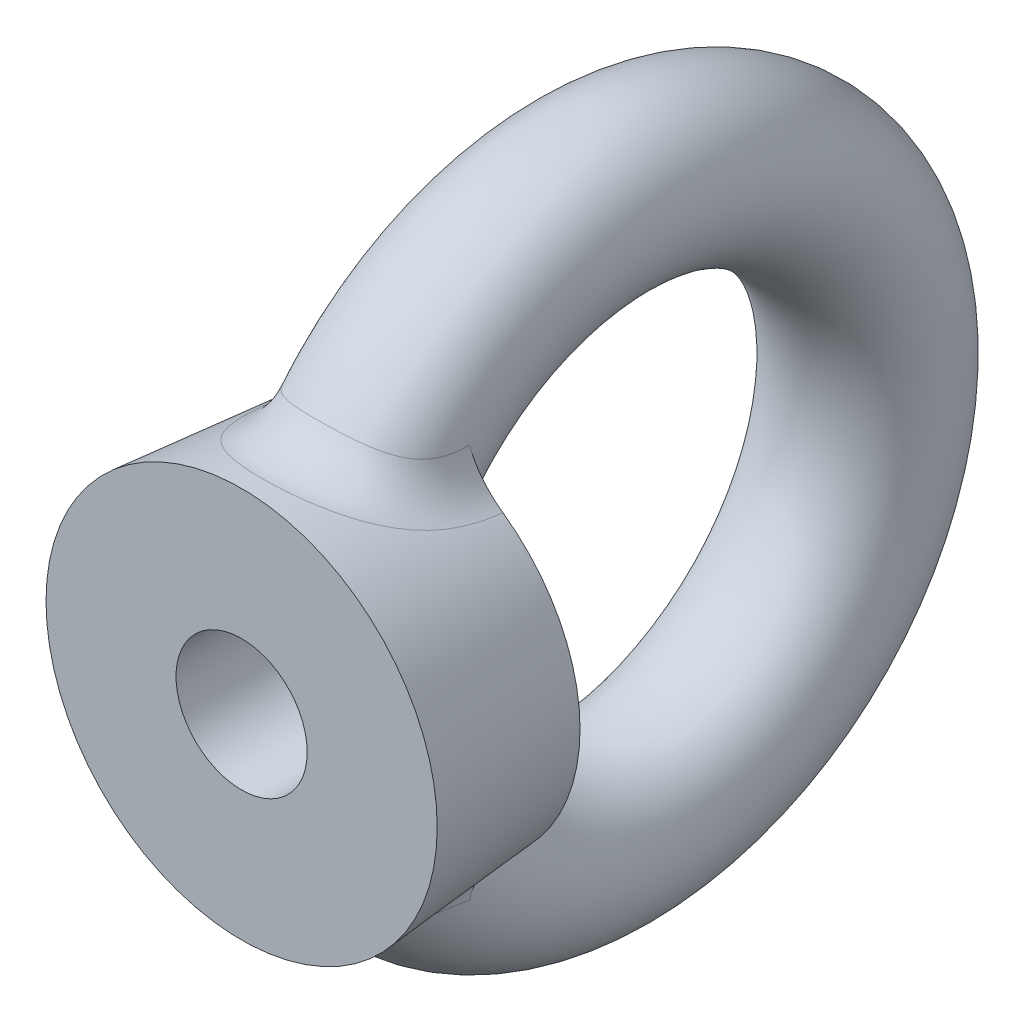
ISO-10303-21;
HEADER;
FILE_DESCRIPTION(('STEP AP214'),'2;1');
FILE_NAME('part.step','',(''),(''),'','','');
FILE_SCHEMA(('AUTOMOTIVE_DESIGN { 1 0 10303 214 1 1 1 1 }'));
ENDSEC;
DATA;
#1=APPLICATION_CONTEXT('core data for automotive mechanical design processes');
#2=APPLICATION_PROTOCOL_DEFINITION('international standard','automotive_design',2000,#1);
#3=PRODUCT_CONTEXT('',#1,'mechanical');
#4=PRODUCT('Part','Part','',(#3));
#5=PRODUCT_RELATED_PRODUCT_CATEGORY('part','',(#4));
#6=PRODUCT_DEFINITION_FORMATION('','',#4);
#7=PRODUCT_DEFINITION_CONTEXT('part definition',#1,'design');
#8=PRODUCT_DEFINITION('design','',#6,#7);
#9=PRODUCT_DEFINITION_SHAPE('','',#8);
#10=(LENGTH_UNIT() NAMED_UNIT(*) SI_UNIT(.MILLI.,.METRE.));
#11=(NAMED_UNIT(*) PLANE_ANGLE_UNIT() SI_UNIT($,.RADIAN.));
#12=(NAMED_UNIT(*) SI_UNIT($,.STERADIAN.) SOLID_ANGLE_UNIT());
#13=UNCERTAINTY_MEASURE_WITH_UNIT(LENGTH_MEASURE(1.E-05),#10,'distance_accuracy_value','');
#14=(GEOMETRIC_REPRESENTATION_CONTEXT(3) GLOBAL_UNCERTAINTY_ASSIGNED_CONTEXT((#13)) GLOBAL_UNIT_ASSIGNED_CONTEXT((#10,
#11,#12)) REPRESENTATION_CONTEXT('',''));
#15=CARTESIAN_POINT('',(0.,0.,0.));
#16=DIRECTION('',(0.,0.,1.));
#17=DIRECTION('',(1.,0.,0.));
#18=AXIS2_PLACEMENT_3D('',#15,#16,#17);
#19=CARTESIAN_POINT('',(0.,0.,-9.99999999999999));
#20=DIRECTION('',(0.,0.,1.));
#21=DIRECTION('',(1.,0.,0.));
#22=AXIS2_PLACEMENT_3D('',#19,#20,#21);
#23=CONICAL_SURFACE('',#22,11.6251133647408,1.36135681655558);
#24=CARTESIAN_POINT('',(0.,0.,-11.4082113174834));
#25=DIRECTION('',(0.,0.,1.));
#26=DIRECTION('',(1.,0.,0.));
#27=AXIS2_PLACEMENT_3D('',#24,#25,#26);
#28=CIRCLE('',#27,5.);
#29=CARTESIAN_POINT('',(5.,0.,-11.4082113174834));
#30=VERTEX_POINT('',#29);
#31=EDGE_CURVE('E91',#30,#30,#28,.T.);
#32=ORIENTED_EDGE('',*,*,#31,.T.);
#33=EDGE_LOOP('',(#32));
#34=FACE_BOUND('',#33,.T.);
#35=CARTESIAN_POINT('',(0.,0.,-9.99999999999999));
#36=DIRECTION('',(0.,0.,1.));
#37=DIRECTION('',(1.,0.,0.));
#38=AXIS2_PLACEMENT_3D('',#35,#36,#37);
#39=CIRCLE('',#38,11.6251133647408);
#40=CARTESIAN_POINT('',(-6.70198521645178,9.49877123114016,-9.99999999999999));
#41=VERTEX_POINT('',#40);
#42=CARTESIAN_POINT('',(-6.70198521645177,-9.49877123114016,-9.99999999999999));
#43=VERTEX_POINT('',#42);
#44=EDGE_CURVE('E84',#41,#43,#39,.T.);
#45=ORIENTED_EDGE('',*,*,#44,.F.);
#46=CARTESIAN_POINT('',(5.53610283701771,9.16063464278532,-20.5336888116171));
#47=CARTESIAN_POINT('',(2.09091066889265,11.2714731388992,-20.2521089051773));
#48=CARTESIAN_POINT('',(4.22062096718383,14.6980644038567,-20.6085942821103));
#49=CARTESIAN_POINT('',(5.55116306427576,9.16882483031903,-20.3645317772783));
#50=CARTESIAN_POINT('',(2.13016037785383,11.2711485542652,-20.060465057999));
#51=CARTESIAN_POINT('',(4.23051953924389,14.6886177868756,-20.413009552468));
#52=CARTESIAN_POINT('',(5.56721237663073,9.17639372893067,-20.1954910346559));
#53=CARTESIAN_POINT('',(2.1722368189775,11.2694124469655,-19.8700608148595));
#54=CARTESIAN_POINT('',(4.24116670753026,14.6767749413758,-20.2184348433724));
#55=CARTESIAN_POINT('',(5.60109841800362,9.1903794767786,-19.8576699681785));
#56=CARTESIAN_POINT('',(2.26108125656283,11.2633621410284,-19.4928633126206));
#57=CARTESIAN_POINT('',(4.26380896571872,14.6486095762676,-19.8316232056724));
#58=CARTESIAN_POINT('',(5.61893500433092,9.19679641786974,-19.6888896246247));
#59=CARTESIAN_POINT('',(2.30778103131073,11.259067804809,-19.3062011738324));
#60=CARTESIAN_POINT('',(4.27580394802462,14.632287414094,-19.6393860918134));
#61=CARTESIAN_POINT('',(5.67482453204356,9.21445089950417,-19.1831117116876));
#62=CARTESIAN_POINT('',(2.45307592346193,11.2428095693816,-18.7540535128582));
#63=CARTESIAN_POINT('',(4.31357652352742,14.5770868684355,-19.0668049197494));
#64=CARTESIAN_POINT('',(5.71527291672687,9.22410022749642,-18.8465055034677));
#65=CARTESIAN_POINT('',(2.55760584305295,11.2274747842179,-18.3927380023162));
#66=CARTESIAN_POINT('',(4.34115209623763,14.5319642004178,-18.6903918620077));
#67=CARTESIAN_POINT('',(5.80086378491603,9.24006088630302,-18.1739817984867));
#68=CARTESIAN_POINT('',(2.77578701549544,11.1899285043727,-17.6844349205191));
#69=CARTESIAN_POINT('',(4.39978172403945,14.4279159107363,-17.9495319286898));
#70=CARTESIAN_POINT('',(5.84601032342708,9.24636930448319,-17.8380651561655));
#71=CARTESIAN_POINT('',(2.88909360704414,11.1678594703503,-17.3378778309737));
#72=CARTESIAN_POINT('',(4.43083878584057,14.368978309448,-17.5850957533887));
#73=CARTESIAN_POINT('',(5.93908204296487,9.2567135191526,-17.1668426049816));
#74=CARTESIAN_POINT('',(3.11894036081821,11.1191940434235,-16.6580866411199));
#75=CARTESIAN_POINT('',(4.49496243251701,14.2405153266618,-16.8695368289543));
#76=CARTESIAN_POINT('',(5.98700755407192,9.26074904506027,-16.8315367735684));
#77=CARTESIAN_POINT('',(3.23530646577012,11.0927013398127,-16.3249692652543));
#78=CARTESIAN_POINT('',(4.52802925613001,14.1709886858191,-16.5184156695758));
#79=CARTESIAN_POINT('',(6.08524207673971,9.26792355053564,-16.1499288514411));
#80=CARTESIAN_POINT('',(3.47019325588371,11.036510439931,-15.6594228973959));
#81=CARTESIAN_POINT('',(4.59575509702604,14.0222862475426,-15.8185495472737));
#82=CARTESIAN_POINT('',(6.13557729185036,9.27102816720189,-15.8036327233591));
#83=CARTESIAN_POINT('',(3.58872256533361,11.0067706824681,-15.3270692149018));
#84=CARTESIAN_POINT('',(4.63043044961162,13.9428660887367,-15.4702737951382));
#85=CARTESIAN_POINT('',(6.23473642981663,9.27777411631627,-15.1106336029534));
#86=CARTESIAN_POINT('',(3.81962942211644,10.9471826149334,-14.6722244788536));
#87=CARTESIAN_POINT('',(4.69853007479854,13.7801729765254,-14.7885735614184));
#88=CARTESIAN_POINT('',(6.28356040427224,9.28141543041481,-14.7639306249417));
#89=CARTESIAN_POINT('',(3.93215490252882,10.917326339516,-14.3494489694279));
#90=CARTESIAN_POINT('',(4.73195439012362,13.6969001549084,-14.4551485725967));
#91=CARTESIAN_POINT('',(6.37713361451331,9.2911145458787,-14.0698925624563));
#92=CARTESIAN_POINT('',(4.14719379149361,10.859856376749,-13.7119851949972));
#93=CARTESIAN_POINT('',(4.79563431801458,13.5305342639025,-13.8032129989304));
#94=CARTESIAN_POINT('',(6.42188689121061,9.29716991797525,-13.7225584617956));
#95=CARTESIAN_POINT('',(4.24997312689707,10.8321792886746,-13.3968909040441));
#96=CARTESIAN_POINT('',(4.82589307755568,13.4474410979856,-13.4846877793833));
#97=CARTESIAN_POINT('',(6.50459118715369,9.31386069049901,-13.0266149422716));
#98=CARTESIAN_POINT('',(4.44220574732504,10.7814115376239,-12.7729470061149));
#99=CARTESIAN_POINT('',(4.88121290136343,13.2854143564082,-12.8618872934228));
#100=CARTESIAN_POINT('',(6.54254377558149,9.32449503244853,-12.6780058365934));
#101=CARTESIAN_POINT('',(4.5319881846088,10.7582173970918,-12.4636030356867));
#102=CARTESIAN_POINT('',(4.90627516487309,13.2064798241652,-12.5576087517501));
#103=CARTESIAN_POINT('',(6.60232096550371,9.35012581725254,-12.0451086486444));
#104=CARTESIAN_POINT('',(4.67977377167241,10.7225158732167,-11.9071687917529));
#105=CARTESIAN_POINT('',(4.94489234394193,13.070932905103,-12.0187918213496));
#106=CARTESIAN_POINT('',(6.62583579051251,9.36392830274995,-11.761033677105));
#107=CARTESIAN_POINT('',(4.74063945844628,10.7087803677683,-11.6595347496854));
#108=CARTESIAN_POINT('',(4.95972434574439,13.0129120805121,-11.7818861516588));
#109=CARTESIAN_POINT('',(6.6644237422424,9.39756165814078,-11.1923905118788));
#110=CARTESIAN_POINT('',(4.84957368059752,10.687259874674,-11.167726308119));
#111=CARTESIAN_POINT('',(4.98305510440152,12.9045363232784,-11.3171960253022));
#112=CARTESIAN_POINT('',(6.67949558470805,9.41739344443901,-10.9078222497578));
#113=CARTESIAN_POINT('',(4.89783176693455,10.679404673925,-10.9232161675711));
#114=CARTESIAN_POINT('',(4.9915528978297,12.8541825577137,-11.0894129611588));
#115=CARTESIAN_POINT('',(6.6990726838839,9.46433916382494,-10.3406365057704));
#116=CARTESIAN_POINT('',(4.9794208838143,10.6709255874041,-10.4395328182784));
#117=CARTESIAN_POINT('',(5.00068586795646,12.7635314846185,-10.644426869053));
#118=CARTESIAN_POINT('',(6.70363554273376,9.49141248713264,-10.0580168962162));
#119=CARTESIAN_POINT('',(5.01300603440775,10.6701975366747,-10.1999914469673));
#120=CARTESIAN_POINT('',(5.00136398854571,12.7231804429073,-10.4271725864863));
#121=CARTESIAN_POINT('',(6.70021513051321,9.55410038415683,-9.4945689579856));
#122=CARTESIAN_POINT('',(5.06380253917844,10.6769041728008,-9.72597051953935));
#123=CARTESIAN_POINT('',(4.99341989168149,12.6540404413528,-10.0023717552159));
#124=CARTESIAN_POINT('',(6.69223240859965,9.58971458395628,-9.21374055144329));
#125=CARTESIAN_POINT('',(5.08116262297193,10.6842877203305,-9.49111579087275));
#126=CARTESIAN_POINT('',(4.98479808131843,12.6252509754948,-9.79482478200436));
#127=CARTESIAN_POINT('',(6.66127816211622,9.67116622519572,-8.65025973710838));
#128=CARTESIAN_POINT('',(5.09804295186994,10.7081081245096,-9.02346202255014));
#129=CARTESIAN_POINT('',(4.95644708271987,12.5801980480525,-9.38605471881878));
#130=CARTESIAN_POINT('',(6.63800723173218,9.71719557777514,-8.36768500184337));
#131=CARTESIAN_POINT('',(5.09731012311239,10.7246955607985,-8.79037363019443));
#132=CARTESIAN_POINT('',(4.93649712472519,12.5641992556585,-9.18504394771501));
#133=CARTESIAN_POINT('',(6.57415780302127,9.81934858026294,-7.80931928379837));
#134=CARTESIAN_POINT('',(5.07582520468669,10.7671179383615,-8.33347839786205));
#135=CARTESIAN_POINT('',(4.8839014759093,12.5464655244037,-8.79485650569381));
#136=CARTESIAN_POINT('',(6.53358000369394,9.8754718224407,-7.53352802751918));
#137=CARTESIAN_POINT('',(5.05513370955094,10.7929502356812,-8.10927934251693));
#138=CARTESIAN_POINT('',(4.85125629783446,12.544730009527,-8.6056793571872));
#139=CARTESIAN_POINT('',(6.43360996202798,9.99726687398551,-6.99206512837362));
#140=CARTESIAN_POINT('',(4.99321043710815,10.8531380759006,-7.6727972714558));
#141=CARTESIAN_POINT('',(4.77223428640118,12.5552933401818,-8.24029943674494));
#142=CARTESIAN_POINT('',(6.37422654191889,10.0629341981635,-6.72638880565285));
#143=CARTESIAN_POINT('',(4.95198899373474,10.8875150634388,-7.46015582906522));
#144=CARTESIAN_POINT('',(4.72586389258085,12.567585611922,-8.0640906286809));
#145=CARTESIAN_POINT('',(6.23580586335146,10.2024510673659,-6.20828011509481));
#146=CARTESIAN_POINT('',(4.84936304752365,10.9633177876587,-7.04911851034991));
#147=CARTESIAN_POINT('',(4.61884459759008,12.6049333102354,-7.72549223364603));
#148=CARTESIAN_POINT('',(6.15677162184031,10.276299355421,-5.95584572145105));
#149=CARTESIAN_POINT('',(4.78790926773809,11.00478786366,-6.85042918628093));
#150=CARTESIAN_POINT('',(4.55819788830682,12.6299867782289,-7.56310053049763));
#151=CARTESIAN_POINT('',(5.992456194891,10.4184135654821,-5.5040772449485));
#152=CARTESIAN_POINT('',(4.65680138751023,11.0860517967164,-6.49810540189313));
#153=CARTESIAN_POINT('',(4.43291244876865,12.6861034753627,-7.27624750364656));
#154=CARTESIAN_POINT('',(5.9099289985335,10.4858338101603,-5.30248742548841));
#155=CARTESIAN_POINT('',(4.58973176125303,11.1251873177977,-6.34204987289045));
#156=CARTESIAN_POINT('',(4.37026571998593,12.7156840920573,-7.14976458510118));
#157=CARTESIAN_POINT('',(5.73102229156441,10.6234804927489,-4.91226639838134));
#158=CARTESIAN_POINT('',(4.44306470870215,11.205633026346,-6.04237151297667));
#159=CARTESIAN_POINT('',(4.2349859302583,12.7808438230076,-6.90734834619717));
#160=CARTESIAN_POINT('',(5.63464319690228,10.6937068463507,-4.72363480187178));
#161=CARTESIAN_POINT('',(4.36340311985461,11.2469733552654,-5.89865848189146));
#162=CARTESIAN_POINT('',(4.16235316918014,12.8164227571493,-6.79141470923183));
#163=CARTESIAN_POINT('',(5.42857039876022,10.8353433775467,-4.36026443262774));
#164=CARTESIAN_POINT('',(4.19283350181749,11.3304265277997,-5.62406835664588));
#165=CARTESIAN_POINT('',(4.00751644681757,12.8918327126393,-6.57003081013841));
#166=CARTESIAN_POINT('',(5.31886877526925,10.9067542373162,-4.18553402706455));
#167=CARTESIAN_POINT('',(4.10185364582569,11.3725635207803,-5.49314754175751));
#168=CARTESIAN_POINT('',(3.92530679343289,12.9316662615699,-6.46458685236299));
#169=CARTESIAN_POINT('',(5.08705214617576,11.049032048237,-3.85084353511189));
#170=CARTESIAN_POINT('',(3.91015627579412,11.4562571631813,-5.24442540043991));
#171=CARTESIAN_POINT('',(3.75199128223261,13.0137818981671,-6.26415025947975));
#172=CARTESIAN_POINT('',(4.96493714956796,11.1198989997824,-3.69088343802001));
#173=CARTESIAN_POINT('',(3.80938077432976,11.497828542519,-5.12660526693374));
#174=CARTESIAN_POINT('',(3.66088543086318,13.0560639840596,-6.16915761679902));
#175=CARTESIAN_POINT('',(4.59733956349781,11.3205159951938,-3.25297770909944));
#176=CARTESIAN_POINT('',(3.50745576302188,11.6148980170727,-4.80637618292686));
#177=CARTESIAN_POINT('',(3.38714951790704,13.1786689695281,-5.91080328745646));
#178=CARTESIAN_POINT('',(4.33724065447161,11.4476495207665,-2.99397003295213));
#179=CARTESIAN_POINT('',(3.29588286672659,11.688110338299,-4.62062897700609));
#180=CARTESIAN_POINT('',(3.19406541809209,13.2599706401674,-5.76016965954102));
#181=CARTESIAN_POINT('',(3.78349679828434,11.6849799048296,-2.53102696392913));
#182=CARTESIAN_POINT('',(2.85260951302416,11.8225324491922,-4.29311082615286));
#183=CARTESIAN_POINT('',(2.78400407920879,13.4154120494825,-5.49320511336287));
#184=CARTESIAN_POINT('',(3.48984248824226,11.7951720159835,-2.32710699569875));
#185=CARTESIAN_POINT('',(2.62082033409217,11.8836713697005,-4.15159210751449));
#186=CARTESIAN_POINT('',(2.56702017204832,13.4895497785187,-5.37688380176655));
#187=CARTESIAN_POINT('',(2.85603662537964,11.9977810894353,-1.96293934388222));
#188=CARTESIAN_POINT('',(2.12830524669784,11.9943071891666,-3.901578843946));
#189=CARTESIAN_POINT('',(2.09946136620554,13.627646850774,-5.17034925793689));
#190=CARTESIAN_POINT('',(2.51409287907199,12.0885341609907,-1.80648574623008));
#191=CARTESIAN_POINT('',(1.86691776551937,12.0426094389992,-3.79628118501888));
#192=CARTESIAN_POINT('',(1.84761302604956,13.6906048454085,-5.082379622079));
#193=CARTESIAN_POINT('',(1.81054742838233,12.235746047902,-1.5570299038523));
#194=CARTESIAN_POINT('',(1.33609961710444,12.1200454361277,-3.62955123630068));
#195=CARTESIAN_POINT('',(1.32998686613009,13.7933978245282,-4.94259662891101));
#196=CARTESIAN_POINT('',(1.44898652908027,12.2922732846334,-1.46390101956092));
#197=CARTESIAN_POINT('',(1.06707207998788,12.1490846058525,-3.56832714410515));
#198=CARTESIAN_POINT('',(1.06423799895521,13.8332789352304,-4.89071110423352));
#199=CARTESIAN_POINT('',(0.991374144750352,12.3392405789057,-1.38697062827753));
#200=CARTESIAN_POINT('',(0.729039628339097,12.1731087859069,-3.5178639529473));
#201=CARTESIAN_POINT('',(0.728056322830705,13.8664813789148,-4.84790011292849));
#202=CARTESIAN_POINT('',(0.899537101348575,12.347451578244,-1.37355513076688));
#203=CARTESIAN_POINT('',(0.661280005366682,12.1773021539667,-3.50906994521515));
#204=CARTESIAN_POINT('',(0.66059707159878,13.8722909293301,-4.84043829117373));
#205=CARTESIAN_POINT('',(0.715387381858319,12.3614930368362,-1.35065604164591));
#206=CARTESIAN_POINT('',(0.525582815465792,12.1844623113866,-3.49407364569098));
#207=CARTESIAN_POINT('',(0.525341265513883,13.8822320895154,-4.82770643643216));
#208=CARTESIAN_POINT('',(0.623074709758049,12.3673235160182,-1.34117241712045));
#209=CARTESIAN_POINT('',(0.457653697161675,12.1874282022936,-3.48787324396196));
#210=CARTESIAN_POINT('',(0.457544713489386,13.8863637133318,-4.82243638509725));
#211=CARTESIAN_POINT('',(0.340199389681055,12.3814674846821,-1.31818411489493));
#212=CARTESIAN_POINT('',(0.249645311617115,12.1946202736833,-3.47284537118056));
#213=CARTESIAN_POINT('',(0.249806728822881,13.8963891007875,-4.80966377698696));
#214=CARTESIAN_POINT('',(0.149107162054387,12.3858727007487,-1.31105523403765));
#215=CARTESIAN_POINT('',(0.109445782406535,12.1968498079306,-3.46820013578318));
#216=CARTESIAN_POINT('',(0.109489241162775,13.8995161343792,-4.80570636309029));
#217=CARTESIAN_POINT('',(-0.233055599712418,12.3843664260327,-1.31349760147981));
#218=CARTESIAN_POINT('',(-0.171056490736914,12.1960855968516,-3.46979443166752));
#219=CARTESIAN_POINT('',(-0.171132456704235,13.898447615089,-4.80706272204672));
#220=CARTESIAN_POINT('',(-0.424126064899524,12.3784492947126,-1.323077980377));
#221=CARTESIAN_POINT('',(-0.311281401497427,12.1930894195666,-3.47603903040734));
#222=CARTESIAN_POINT('',(-0.311436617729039,13.8942480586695,-4.81238156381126));
#223=CARTESIAN_POINT('',(-0.805125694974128,12.3563741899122,-1.35898564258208));
#224=CARTESIAN_POINT('',(-0.591571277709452,12.1818580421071,-3.49951980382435));
#225=CARTESIAN_POINT('',(-0.591245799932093,13.8786052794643,-4.83233560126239));
#226=CARTESIAN_POINT('',(-0.995052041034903,12.3401969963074,-1.38534435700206));
#227=CARTESIAN_POINT('',(-0.731559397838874,12.1736191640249,-3.51676371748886));
#228=CARTESIAN_POINT('',(-0.730748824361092,13.8671484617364,-4.84698828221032));
#229=CARTESIAN_POINT('',(-1.37205968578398,12.2978694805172,-1.45484229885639));
#230=CARTESIAN_POINT('',(-1.01062812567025,12.1519075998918,-3.5624490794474));
#231=CARTESIAN_POINT('',(-1.00774035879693,13.8372513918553,-4.88568237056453));
#232=CARTESIAN_POINT('',(-1.55913987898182,12.2717153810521,-1.49798788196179));
#233=CARTESIAN_POINT('',(-1.14963765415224,12.1384443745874,-3.59087048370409));
#234=CARTESIAN_POINT('',(-1.14522808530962,13.8188084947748,-4.90972733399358));
#235=CARTESIAN_POINT('',(-1.92880157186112,12.2099404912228,-1.60099638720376));
#236=CARTESIAN_POINT('',(-1.42593552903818,12.1063514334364,-3.65915043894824));
#237=CARTESIAN_POINT('',(-1.41700869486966,13.7754151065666,-4.96725984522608));
#238=CARTESIAN_POINT('',(-2.11138805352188,12.1743307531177,-1.66083979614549));
#239=CARTESIAN_POINT('',(-1.56316377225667,12.0877435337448,-3.69896134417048));
#240=CARTESIAN_POINT('',(-1.55130510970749,13.7504722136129,-5.00073637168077));
#241=CARTESIAN_POINT('',(-2.47095530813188,12.0943013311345,-1.79724446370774));
#242=CARTESIAN_POINT('',(-1.83531796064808,12.0454832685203,-3.79038319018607));
#243=CARTESIAN_POINT('',(-1.81592140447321,13.6947168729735,-5.07726348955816));
#244=CARTESIAN_POINT('',(-2.64793393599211,12.0498783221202,-1.87381203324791));
#245=CARTESIAN_POINT('',(-1.97019415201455,12.0218475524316,-3.84195664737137));
#246=CARTESIAN_POINT('',(-1.94623976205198,13.6639022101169,-5.12031769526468));
#247=CARTESIAN_POINT('',(-3.16814146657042,11.9046605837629,-2.12845572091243));
#248=CARTESIAN_POINT('',(-2.36940230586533,11.943774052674,-4.01470562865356));
#249=CARTESIAN_POINT('',(-2.32957012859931,13.5638696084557,-5.26400825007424));
#250=CARTESIAN_POINT('',(-3.50121475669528,11.791818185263,-2.3316300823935));
#251=CARTESIAN_POINT('',(-2.6294815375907,11.8820553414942,-4.15413323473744));
#252=CARTESIAN_POINT('',(-2.5753783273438,13.4869922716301,-5.37925942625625));
#253=CARTESIAN_POINT('',(-4.12799911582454,11.5434339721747,-2.80342092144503));
#254=CARTESIAN_POINT('',(-3.1269793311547,11.7427966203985,-4.48491600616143));
#255=CARTESIAN_POINT('',(-3.03894219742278,13.3220426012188,-5.64985520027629));
#256=CARTESIAN_POINT('',(-4.4218837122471,11.4079986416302,-3.07173297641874));
#257=CARTESIAN_POINT('',(-3.36451327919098,11.6654464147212,-4.67567656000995));
#258=CARTESIAN_POINT('',(-3.25682136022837,13.2340232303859,-5.80501348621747));
#259=CARTESIAN_POINT('',(-4.82746844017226,11.1964357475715,-3.52212885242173));
#260=CARTESIAN_POINT('',(-3.6963517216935,11.5425455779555,-5.00300832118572));
#261=CARTESIAN_POINT('',(-3.55845864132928,13.1025136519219,-6.06940184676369));
#262=CARTESIAN_POINT('',(-4.95686188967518,11.1244638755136,-3.68036661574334));
#263=CARTESIAN_POINT('',(-3.80279410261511,11.5004818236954,-5.11883238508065));
#264=CARTESIAN_POINT('',(-3.65486165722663,13.0587355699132,-6.16287714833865));
#265=CARTESIAN_POINT('',(-5.20290694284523,10.9793902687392,-4.01244816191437));
#266=CARTESIAN_POINT('',(-4.00583821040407,11.4153456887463,-5.36416044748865));
#267=CARTESIAN_POINT('',(-3.83854239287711,12.9731372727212,-6.36067009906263));
#268=CARTESIAN_POINT('',(-5.31956469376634,10.9062890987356,-4.18628434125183));
#269=CARTESIAN_POINT('',(-4.10250254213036,11.3722616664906,-5.49366734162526));
#270=CARTESIAN_POINT('',(-3.92582451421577,12.9313161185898,-6.46498246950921));
#271=CARTESIAN_POINT('',(-5.53476924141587,10.7636726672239,-4.54153916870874));
#272=CARTESIAN_POINT('',(-4.28074734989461,11.2881963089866,-5.76069699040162));
#273=CARTESIAN_POINT('',(-4.08724137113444,12.8531226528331,-6.68016787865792));
#274=CARTESIAN_POINT('',(-5.63385925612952,10.694132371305,-4.72236290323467));
#275=CARTESIAN_POINT('',(-4.36283596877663,11.2471835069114,-5.89770921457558));
#276=CARTESIAN_POINT('',(-4.16176616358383,12.8165980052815,-6.79060224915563));
#277=CARTESIAN_POINT('',(-5.81880586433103,10.5572461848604,-5.09682191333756));
#278=CARTESIAN_POINT('',(-4.51518641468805,11.1668537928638,-6.18372427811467));
#279=CARTESIAN_POINT('',(-4.30128465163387,12.7487776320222,-7.02162289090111));
#280=CARTESIAN_POINT('',(-5.90466846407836,10.4898993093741,-5.29045131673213));
#281=CARTESIAN_POINT('',(-4.58551579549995,11.1275092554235,-6.33279373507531));
#282=CARTESIAN_POINT('',(-4.36628267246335,12.7174795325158,-7.14220451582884));
#283=CARTESIAN_POINT('',(-6.06260342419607,10.3590479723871,-5.6889129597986));
#284=CARTESIAN_POINT('',(-4.71310549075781,11.0519526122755,-6.64186207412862));
#285=CARTESIAN_POINT('',(-4.48630883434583,12.6617676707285,-7.39315859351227));
#286=CARTESIAN_POINT('',(-6.1347078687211,10.2955348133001,-5.89371766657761));
#287=CARTESIAN_POINT('',(-4.7704521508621,11.0157030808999,-6.80194340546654));
#288=CARTESIAN_POINT('',(-4.54136015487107,12.6373378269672,-7.52350725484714));
#289=CARTESIAN_POINT('',(-6.26525897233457,10.1735170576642,-6.31342579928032));
#290=CARTESIAN_POINT('',(-4.87145572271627,10.9474959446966,-7.13227652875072));
#291=CARTESIAN_POINT('',(-4.64156092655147,12.5966456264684,-7.79396405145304));
#292=CARTESIAN_POINT('',(-6.32370648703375,10.1150121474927,-6.52832859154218));
#293=CARTESIAN_POINT('',(-4.91515512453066,10.9155089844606,-7.3026746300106));
#294=CARTESIAN_POINT('',(-4.68671099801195,12.580382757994,-7.93407157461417));
#295=CARTESIAN_POINT('',(-6.424150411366,10.0073011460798,-6.95363179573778));
#296=CARTESIAN_POINT('',(-4.98628158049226,10.8585813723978,-7.64204860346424));
#297=CARTESIAN_POINT('',(-4.76488609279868,12.557727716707,-8.21511718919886));
#298=CARTESIAN_POINT('',(-6.46691000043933,9.95775108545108,-7.16355840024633));
#299=CARTESIAN_POINT('',(-5.01453149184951,10.8333163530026,-7.81068901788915));
#300=CARTESIAN_POINT('',(-4.79846649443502,12.5508130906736,-8.35552575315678));
#301=CARTESIAN_POINT('',(-6.54103167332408,9.86456318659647,-7.58926236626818));
#302=CARTESIAN_POINT('',(-5.05851041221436,10.7881007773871,-8.15459376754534));
#303=CARTESIAN_POINT('',(-4.85730270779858,12.5456054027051,-8.64414780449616));
#304=CARTESIAN_POINT('',(-6.57239295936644,9.82092576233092,-7.80504013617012));
#305=CARTESIAN_POINT('',(-5.07423434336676,10.7681400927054,-8.33003067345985));
#306=CARTESIAN_POINT('',(-4.88255793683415,12.5473129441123,-8.79236183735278));
#307=CARTESIAN_POINT('',(-6.62463805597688,9.7395146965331,-8.24245237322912));
#308=CARTESIAN_POINT('',(-5.09354327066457,10.733717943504,-8.68754928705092));
#309=CARTESIAN_POINT('',(-4.92540210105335,12.5594890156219,-9.09716212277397));
#310=CARTESIAN_POINT('',(-6.64544563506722,9.70178504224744,-8.4641176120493));
#311=CARTESIAN_POINT('',(-5.09701394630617,10.7192969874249,-8.86985531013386));
#312=CARTESIAN_POINT('',(-4.94293514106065,12.5700198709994,-9.25380049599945));
#313=CARTESIAN_POINT('',(-6.67719324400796,9.63250134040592,-8.9103075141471));
#314=CARTESIAN_POINT('',(-5.09218638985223,10.6961688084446,-9.23868154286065));
#315=CARTESIAN_POINT('',(-4.97073591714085,12.599630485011,-9.57391181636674));
#316=CARTESIAN_POINT('',(-6.68813692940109,9.6009450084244,-9.13483108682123));
#317=CARTESIAN_POINT('',(-5.0838439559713,10.6874705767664,-9.42539727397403));
#318=CARTESIAN_POINT('',(-4.98100634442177,12.618707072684,-9.73738220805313));
#319=CARTESIAN_POINT('',(-6.7024528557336,9.53836408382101,-9.62723161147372));
#320=CARTESIAN_POINT('',(-5.05364289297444,10.6744257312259,-9.83708580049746));
#321=CARTESIAN_POINT('',(-4.99635179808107,12.6690661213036,-10.1015625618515));
#322=CARTESIAN_POINT('',(-6.70405633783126,9.50851105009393,-9.89546679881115));
#323=CARTESIAN_POINT('',(-5.029487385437,10.6712174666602,-10.062845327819));
#324=CARTESIAN_POINT('',(-5.00011920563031,12.7019508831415,-10.3035800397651));
#325=CARTESIAN_POINT('',(-6.69679451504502,9.45605505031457,-10.4330021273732));
#326=CARTESIAN_POINT('',(-4.96737530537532,10.6716901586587,-10.5178785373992));
#327=CARTESIAN_POINT('',(-4.9998750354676,12.7774593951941,-10.7162505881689));
#328=CARTESIAN_POINT('',(-6.68792458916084,9.43345529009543,-10.7023026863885));
#329=CARTESIAN_POINT('',(-4.92927307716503,10.6754243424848,-10.7474695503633));
#330=CARTESIAN_POINT('',(-4.99586002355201,12.8200874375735,-10.9269074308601));
#331=CARTESIAN_POINT('',(-6.64827759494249,9.37472166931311,-11.5121221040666));
#332=CARTESIAN_POINT('',(-4.7958383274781,10.6956064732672,-11.4449257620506));
#333=CARTESIAN_POINT('',(-4.97408829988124,12.9603786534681,-11.572894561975));
#334=CARTESIAN_POINT('',(-6.60443473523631,9.34787495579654,-12.0526846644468));
#335=CARTESIAN_POINT('',(-4.68167294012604,10.7212663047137,-11.9157767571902));
#336=CARTESIAN_POINT('',(-4.9465653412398,13.0702365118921,-12.0208626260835));
#337=CARTESIAN_POINT('',(-6.52325033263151,9.31929683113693,-12.8531575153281));
#338=CARTESIAN_POINT('',(-4.48677385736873,10.769931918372,-12.6182399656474));
#339=CARTESIAN_POINT('',(-4.89351247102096,13.2462678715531,-12.7109530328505));
#340=CARTESIAN_POINT('',(-6.49414703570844,9.31174874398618,-13.114531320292));
#341=CARTESIAN_POINT('',(-4.41825618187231,10.7877348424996,-12.8507144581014));
#342=CARTESIAN_POINT('',(-4.87422741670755,13.3058768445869,-12.9405497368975));
#343=CARTESIAN_POINT('',(-6.43209797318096,9.29923484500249,-13.6366031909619));
#344=CARTESIAN_POINT('',(-4.27403293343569,10.8258268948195,-13.3187651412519));
#345=CARTESIAN_POINT('',(-4.83272266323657,13.427435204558,-13.4077803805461));
#346=CARTESIAN_POINT('',(-6.39915181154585,9.29426929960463,-13.8973011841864));
#347=CARTESIAN_POINT('',(-4.19818877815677,10.8461596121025,-13.5545506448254));
#348=CARTESIAN_POINT('',(-4.81050266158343,13.4893848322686,-13.6454151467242));
#349=CARTESIAN_POINT('',(-6.33093417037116,9.28602581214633,-14.415718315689));
#350=CARTESIAN_POINT('',(-4.04144412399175,10.8881332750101,-14.0276299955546));
#351=CARTESIAN_POINT('',(-4.76423297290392,13.6133362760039,-14.1266355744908));
#352=CARTESIAN_POINT('',(-6.29568642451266,9.2827330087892,-14.6734430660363));
#353=CARTESIAN_POINT('',(-3.96047190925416,10.9097932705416,-14.2650938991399));
#354=CARTESIAN_POINT('',(-4.74020165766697,13.6753325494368,-14.3701479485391));
#355=CARTESIAN_POINT('',(-6.22366788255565,9.27697099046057,-15.1884139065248));
#356=CARTESIAN_POINT('',(-3.79426777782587,10.9536822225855,-14.7445100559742));
#357=CARTESIAN_POINT('',(-4.69093152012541,13.7982800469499,-14.865197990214));
#358=CARTESIAN_POINT('',(-6.18689763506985,9.27450148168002,-15.4456601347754));
#359=CARTESIAN_POINT('',(-3.70895170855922,10.9759262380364,-14.9866045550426));
#360=CARTESIAN_POINT('',(-4.66569313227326,13.8592316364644,-15.1167327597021));
#361=CARTESIAN_POINT('',(-6.14988537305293,9.27204445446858,-15.7028256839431));
#362=CARTESIAN_POINT('',(-3.62287475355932,10.9978113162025,-15.2296856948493));
#363=CARTESIAN_POINT('',(-4.64024004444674,13.9188592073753,-15.3723827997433));
#364=(BOUNDED_SURFACE() B_SPLINE_SURFACE(3,2,((#46,#47,#48),(#49,#50,#51),(#52,#53,#54),(#55,
#56,#57),(#58,#59,#60),(#61,#62,#63),(#64,#65,#66),(#67,#68,#69),(#70,#71,#72),(#73,#74,#75),
(#76,#77,#78),(#79,#80,#81),(#82,#83,#84),(#85,#86,#87),(#88,#89,#90),(#91,#92,#93),(#94,#95,
#96),(#97,#98,#99),(#100,#101,#102),(#103,#104,#105),(#106,#107,#108),(#109,#110,#111),(#112,
#113,#114),(#115,#116,#117),(#118,#119,#120),(#121,#122,#123),(#124,#125,#126),(#127,#128,#129),
(#130,#131,#132),(#133,#134,#135),(#136,#137,#138),(#139,#140,#141),(#142,#143,#144),(#145,#146,
#147),(#148,#149,#150),(#151,#152,#153),(#154,#155,#156),(#157,#158,#159),(#160,#161,#162),
(#163,#164,#165),(#166,#167,#168),(#169,#170,#171),(#172,#173,#174),(#175,#176,#177),(#178,#179,
#180),(#181,#182,#183),(#184,#185,#186),(#187,#188,#189),(#190,#191,#192),(#193,#194,#195),
(#196,#197,#198),(#199,#200,#201),(#202,#203,#204),(#205,#206,#207),(#208,#209,#210),(#211,#212,
#213),(#214,#215,#216),(#217,#218,#219),(#220,#221,#222),(#223,#224,#225),(#226,#227,#228),
(#229,#230,#231),(#232,#233,#234),(#235,#236,#237),(#238,#239,#240),(#241,#242,#243),(#244,#245,
#246),(#247,#248,#249),(#250,#251,#252),(#253,#254,#255),(#256,#257,#258),(#259,#260,#261),
(#262,#263,#264),(#265,#266,#267),(#268,#269,#270),(#271,#272,#273),(#274,#275,#276),(#277,#278,
#279),(#280,#281,#282),(#283,#284,#285),(#286,#287,#288),(#289,#290,#291),(#292,#293,#294),
(#295,#296,#297),(#298,#299,#300),(#301,#302,#303),(#304,#305,#306),(#307,#308,#309),(#310,#311,
#312),(#313,#314,#315),(#316,#317,#318),(#319,#320,#321),(#322,#323,#324),(#325,#326,#327),
(#328,#329,#330),(#331,#332,#333),(#334,#335,#336),(#337,#338,#339),(#340,#341,#342),(#343,#344,
#345),(#346,#347,#348),(#349,#350,#351),(#352,#353,#354),(#355,#356,#357),(#358,#359,#360),
(#361,#362,#363)),.UNSPECIFIED.,.F.,.F.,.F.) B_SPLINE_SURFACE_WITH_KNOTS((4,2,2,2,2,2,2,2,2,2,2,
2,2,2,2,2,2,2,2,2,2,2,2,2,2,2,2,2,2,2,2,2,2,2,2,2,2,2,2,2,2,2,2,2,2,2,2,2,2,2,2,2,4),(3,3),(0.,
0.510635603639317,1.02123047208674,2.04190181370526,3.06346152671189,4.08514282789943,
5.14087500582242,6.19657109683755,7.25120751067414,8.30560026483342,9.16201668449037,
10.0185633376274,10.8704037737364,11.7222069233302,12.5912100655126,13.4601781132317,
14.3287391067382,15.1971668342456,15.9342129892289,16.6712370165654,17.4087013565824,
18.1461651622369,19.5275678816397,20.9093569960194,22.3828025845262,23.8532927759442,
24.2210826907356,24.5888695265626,25.3461057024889,26.1037557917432,26.8628293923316,
27.6221906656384,28.3806682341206,29.1394325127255,30.6546391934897,32.162896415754,
32.918002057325,33.6727415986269,34.3968206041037,35.1205698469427,35.8426101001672,
36.5646051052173,37.2443023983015,37.9240472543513,38.6086345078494,39.2929679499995,
40.1035197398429,40.9144292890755,42.5418923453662,43.3329738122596,44.1241368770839,
44.9081423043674,45.69186764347),(0.,1.),
.UNSPECIFIED.) GEOMETRIC_REPRESENTATION_ITEM() RATIONAL_B_SPLINE_SURFACE(((1.,0.702682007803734,
1.),(1.,0.7047467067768,1.),(1.,0.706977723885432,1.),(1.,0.711733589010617,1.),(1.,
0.714258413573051,1.),(1.,0.722213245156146,1.),(1.,0.728025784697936,1.),(1.,0.740356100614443,
1.),(1.,0.746874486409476,1.),(1.,0.760306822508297,1.),(1.,0.767220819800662,1.),(1.,
0.781400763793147,1.),(1.,0.788670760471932,1.),(1.,0.803075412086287,1.),(1.,0.810210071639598,
1.),(1.,0.824114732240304,1.),(1.,0.830885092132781,1.),(1.,0.843879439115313,1.),(1.,
0.850103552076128,1.),(1.,0.86074439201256,1.),(1.,0.865281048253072,1.),(1.,0.873816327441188,
1.),(1.,0.877814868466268,1.),(1.,0.885189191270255,1.),(1.,0.888568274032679,1.),(1.,
0.894681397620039,1.),(1.,0.897415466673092,1.),(1.,0.902256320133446,1.),(1.,0.904349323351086,
1.),(1.,0.907825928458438,1.),(1.,0.909209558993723,1.),(1.,0.911294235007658,1.),(1.,
0.911995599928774,1.),(1.,0.912778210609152,1.),(1.,0.912859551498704,1.),(1.,0.912520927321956,
1.),(1.,0.912174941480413,1.),(1.,0.911168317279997,1.),(1.,0.910507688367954,1.),(1.,
0.908941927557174,1.),(1.,0.908036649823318,1.),(1.,0.906053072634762,1.),(1.,0.904974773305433,
1.),(1.,0.901725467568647,1.),(1.,0.89942247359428,1.),(1.,0.894854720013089,1.),(1.,
0.892589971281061,1.),(1.,0.888283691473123,1.),(1.,0.886266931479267,1.),(1.,0.882937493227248,
1.),(1.,0.881623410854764,1.),(1.,0.880525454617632,1.),(1.,0.880333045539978,1.),(1.,
0.88000343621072,1.),(1.,0.879866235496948,1.),(1.,0.879533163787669,1.),(1.,0.879429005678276,
1.),(1.,0.879464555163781,1.),(1.,0.879604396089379,1.),(1.,0.880123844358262,1.),(1.,
0.880503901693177,1.),(1.,0.881491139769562,1.),(1.,0.882098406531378,1.),(1.,0.883517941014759,
1.),(1.,0.884329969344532,1.),(1.,0.886129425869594,1.),(1.,0.887116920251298,1.),(1.,
0.890287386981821,1.),(1.,0.89268071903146,1.),(1.,0.897627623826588,1.),(1.,0.900180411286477,
1.),(1.,0.903757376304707,1.),(1.,0.904908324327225,1.),(1.,0.907053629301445,1.),(1.,
0.908048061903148,1.),(1.,0.909769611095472,1.),(1.,0.910505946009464,1.),(1.,0.911697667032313,
1.),(1.,0.91215318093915,1.),(1.,0.912718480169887,1.),(1.,0.912829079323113,1.),(1.,
0.912649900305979,1.),(1.,0.912360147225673,1.),(1.,0.911365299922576,1.),(1.,0.910685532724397,
1.),(1.,0.908905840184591,1.),(1.,0.907805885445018,1.),(1.,0.905163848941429,1.),(1.,
0.903618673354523,1.),(1.,0.900090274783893,1.),(1.,0.898107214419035,1.),(1.,0.893307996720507,
1.),(1.,0.89040564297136,1.),(1.,0.884035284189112,1.),(1.,0.880567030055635,1.),(1.,
0.869354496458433,1.),(1.,0.860821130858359,1.),(1.,0.846959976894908,1.),(1.,0.842238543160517,
1.),(1.,0.83248936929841,1.),(1.,0.827461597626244,1.),(1.,0.817223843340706,1.),(1.,
0.812015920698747,1.),(1.,0.801465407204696,1.),(1.,0.796122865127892,1.),(1.,0.790756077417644,1.))) REPRESENTATION_ITEM('') SURFACE());
#365=CARTESIAN_POINT('',(-6.70198521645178,9.49877123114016,-9.99999999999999));
#366=CARTESIAN_POINT('',(-6.61227628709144,9.56204711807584,-10.0000085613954));
#367=CARTESIAN_POINT('',(-6.52526626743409,9.62912155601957,-9.99868589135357));
#368=CARTESIAN_POINT('',(-6.35721584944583,9.7702204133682,-9.99345916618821));
#369=CARTESIAN_POINT('',(-6.27617310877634,9.84424207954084,-9.98955613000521));
#370=CARTESIAN_POINT('',(-6.12098315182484,9.99821677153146,-9.97927782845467));
#371=CARTESIAN_POINT('',(-6.04680063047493,10.0781351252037,-9.97291620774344));
#372=CARTESIAN_POINT('',(-5.90525154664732,10.2435625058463,-9.95786031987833));
#373=CARTESIAN_POINT('',(-5.83788537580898,10.3290718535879,-9.94916591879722));
#374=CARTESIAN_POINT('',(-5.64668427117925,10.5927660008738,-9.91984425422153));
#375=CARTESIAN_POINT('',(-5.53343974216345,10.7784239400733,-9.89595718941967));
#376=CARTESIAN_POINT('',(-5.33682080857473,11.1641953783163,-9.84103728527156));
#377=CARTESIAN_POINT('',(-5.25350174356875,11.3643348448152,-9.80999137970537));
#378=CARTESIAN_POINT('',(-5.12931812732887,11.7371334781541,-9.74847940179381));
#379=CARTESIAN_POINT('',(-5.08353305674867,11.9083309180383,-9.71889664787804));
#380=CARTESIAN_POINT('',(-5.01217884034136,12.253763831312,-9.65698960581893));
#381=CARTESIAN_POINT('',(-4.98653812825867,12.4279862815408,-9.62467547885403));
#382=CARTESIAN_POINT('',(-4.97068576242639,12.6028250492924,-9.59135147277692));
#383=B_SPLINE_CURVE_WITH_KNOTS('',3,(#365,#366,#367,#368,#369,#370,#371,#372,#373,#374,#375,
#376,#377,#378,#379,#380,#381,#382),.UNSPECIFIED.,.F.,.F.,(4,2,2,2,2,2,2,2,4),(0.,
0.329207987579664,0.658286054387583,0.985563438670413,1.31285961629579,1.9661637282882,
2.62066981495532,3.15849457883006,3.69439987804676),.UNSPECIFIED.);
#384=CARTESIAN_POINT('',(-4.97068576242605,12.6028250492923,-9.59135147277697));
#385=VERTEX_POINT('',#384);
#386=EDGE_CURVE('E38',#41,#385,#383,.T.);
#387=ORIENTED_EDGE('',*,*,#386,.T.);
#388=CARTESIAN_POINT('',(-4.97068576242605,12.6028250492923,-9.59135147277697));
#389=CARTESIAN_POINT('',(-5.0016668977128,12.2616382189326,-9.65639971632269));
#390=CARTESIAN_POINT('',(-5.0077943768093,11.9183783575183,-9.72324143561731));
#391=CARTESIAN_POINT('',(-4.97305713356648,11.2344826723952,-9.85965517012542));
#392=CARTESIAN_POINT('',(-4.93210949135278,10.8938525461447,-9.92923179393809));
#393=CARTESIAN_POINT('',(-4.79198471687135,10.1496270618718,-10.085359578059));
#394=CARTESIAN_POINT('',(-4.68228538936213,9.74802810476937,-10.1723767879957));
#395=CARTESIAN_POINT('',(-4.47055485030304,9.1633644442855,-10.3038262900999));
#396=CARTESIAN_POINT('',(-4.39205879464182,8.97133262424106,-10.3478209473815));
#397=CARTESIAN_POINT('',(-4.21932717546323,8.59446438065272,-10.4359112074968));
#398=CARTESIAN_POINT('',(-4.12509547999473,8.4096262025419,-10.4800067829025));
#399=CARTESIAN_POINT('',(-3.94125908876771,8.08499789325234,-10.5591588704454));
#400=CARTESIAN_POINT('',(-3.854504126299,7.94359680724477,-10.594257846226));
#401=CARTESIAN_POINT('',(-3.67070329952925,7.66751854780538,-10.6640836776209));
#402=CARTESIAN_POINT('',(-3.57365730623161,7.53284145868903,-10.6988105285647));
#403=CARTESIAN_POINT('',(-3.36919540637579,7.27166860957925,-10.7675255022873));
#404=CARTESIAN_POINT('',(-3.26179429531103,7.14516159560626,-10.8015145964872));
#405=CARTESIAN_POINT('',(-3.03637556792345,6.90176421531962,-10.8683238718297));
#406=CARTESIAN_POINT('',(-2.9183614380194,6.78487071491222,-10.9011444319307));
#407=CARTESIAN_POINT('',(-2.61345389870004,6.51031022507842,-10.9800184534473));
#408=CARTESIAN_POINT('',(-2.42018896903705,6.35919021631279,-11.0250696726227));
#409=CARTESIAN_POINT('',(-2.11355396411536,6.15675714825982,-11.0874563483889));
#410=CARTESIAN_POINT('',(-2.00857047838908,6.09332866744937,-11.1073841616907));
#411=CARTESIAN_POINT('',(-1.79330719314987,5.97548506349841,-11.145024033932));
#412=CARTESIAN_POINT('',(-1.68303060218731,5.92106456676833,-11.1627374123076));
#413=CARTESIAN_POINT('',(-1.47444584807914,5.82951881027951,-11.1929898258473));
#414=CARTESIAN_POINT('',(-1.37679117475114,5.79102535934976,-11.2059066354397));
#415=CARTESIAN_POINT('',(-1.17853572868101,5.72178688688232,-11.2294048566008));
#416=CARTESIAN_POINT('',(-1.07793633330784,5.69103830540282,-11.2399873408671));
#417=CARTESIAN_POINT('',(-0.874345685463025,5.63770378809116,-11.258508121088));
#418=CARTESIAN_POINT('',(-0.771354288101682,5.61511834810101,-11.2664462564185));
#419=CARTESIAN_POINT('',(-0.563683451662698,5.5784326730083,-11.2794165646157));
#420=CARTESIAN_POINT('',(-0.459003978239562,5.56433261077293,-11.2844486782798));
#421=CARTESIAN_POINT('',(-0.248472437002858,5.54479289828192,-11.2914385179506));
#422=CARTESIAN_POINT('',(-0.14261810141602,5.5393748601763,-11.2933885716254));
#423=CARTESIAN_POINT('',(0.0691863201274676,5.53734237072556,-11.2941190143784));
#424=CARTESIAN_POINT('',(0.175136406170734,5.54072792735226,-11.2928994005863));
#425=CARTESIAN_POINT('',(0.386303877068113,5.55625516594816,-11.2873353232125));
#426=CARTESIAN_POINT('',(0.491521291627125,5.56839649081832,-11.2829909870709));
#427=CARTESIAN_POINT('',(0.700433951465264,5.60126318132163,-11.2713327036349));
#428=CARTESIAN_POINT('',(0.80412921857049,5.6219884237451,-11.2640187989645));
#429=CARTESIAN_POINT('',(1.0053547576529,5.67077842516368,-11.2469987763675));
#430=CARTESIAN_POINT('',(1.10296923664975,5.69853267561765,-11.2373946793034));
#431=CARTESIAN_POINT('',(1.29558229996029,5.7613433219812,-11.2159401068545));
#432=CARTESIAN_POINT('',(1.39058001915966,5.79640210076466,-11.2040888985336));
#433=CARTESIAN_POINT('',(1.67085376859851,5.91185245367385,-11.165622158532));
#434=CARTESIAN_POINT('',(1.85154379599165,6.00255118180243,-11.1360815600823));
#435=CARTESIAN_POINT('',(2.26702092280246,6.24792543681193,-11.0587940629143));
#436=CARTESIAN_POINT('',(2.49476698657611,6.41370127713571,-11.0084774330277));
#437=CARTESIAN_POINT('',(2.81321831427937,6.68769336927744,-10.9288858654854));
#438=CARTESIAN_POINT('',(2.91567078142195,6.78344065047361,-10.9016164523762));
#439=CARTESIAN_POINT('',(3.11293256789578,6.98224458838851,-10.8460904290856));
#440=CARTESIAN_POINT('',(3.20774353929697,7.08529965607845,-10.8178340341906));
#441=CARTESIAN_POINT('',(3.42435198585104,7.33794961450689,-10.7498256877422));
#442=CARTESIAN_POINT('',(3.54275281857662,7.49037609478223,-10.709776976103));
#443=CARTESIAN_POINT('',(3.76560251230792,7.80497595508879,-10.6290179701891));
#444=CARTESIAN_POINT('',(3.87004543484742,7.96715344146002,-10.5883074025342));
#445=CARTESIAN_POINT('',(4.06514794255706,8.29938848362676,-10.5066555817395));
#446=CARTESIAN_POINT('',(4.15581549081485,8.46944141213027,-10.4657144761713));
#447=CARTESIAN_POINT('',(4.32353415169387,8.81604155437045,-10.3838710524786));
#448=CARTESIAN_POINT('',(4.40058964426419,8.99258665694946,-10.3429687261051));
#449=CARTESIAN_POINT('',(4.55863318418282,9.39576066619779,-10.2512169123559));
#450=CARTESIAN_POINT('',(4.6358154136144,9.62390621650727,-10.2004288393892));
#451=CARTESIAN_POINT('',(4.76860753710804,10.0864453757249,-10.099540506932));
#452=CARTESIAN_POINT('',(4.82422109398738,10.32083791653,-10.0494401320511));
#453=CARTESIAN_POINT('',(4.93206171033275,10.8936013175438,-9.92928716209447));
#454=CARTESIAN_POINT('',(4.97303212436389,11.2342515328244,-9.85970298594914));
#455=CARTESIAN_POINT('',(5.00780320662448,11.9182918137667,-9.72325699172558));
#456=CARTESIAN_POINT('',(5.00166505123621,12.2616777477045,-9.6563917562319));
#457=CARTESIAN_POINT('',(4.96400657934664,12.6763769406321,-9.57732868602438));
#458=CARTESIAN_POINT('',(4.95617268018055,12.7498247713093,-9.56339073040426));
#459=CARTESIAN_POINT('',(4.93816638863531,12.8964878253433,-9.53568365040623));
#460=CARTESIAN_POINT('',(4.92799343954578,12.9697029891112,-9.5219145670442));
#461=CARTESIAN_POINT('',(4.88953622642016,13.2170841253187,-9.47559525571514));
#462=CARTESIAN_POINT('',(4.85569371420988,13.3905032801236,-9.44346825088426));
#463=CARTESIAN_POINT('',(4.77419295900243,13.7342956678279,-9.38039982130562));
#464=CARTESIAN_POINT('',(4.72653344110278,13.9046686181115,-9.34945850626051));
#465=CARTESIAN_POINT('',(4.61697803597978,14.2415083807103,-9.28884430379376));
#466=CARTESIAN_POINT('',(4.5550474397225,14.4079645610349,-9.25917472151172));
#467=CARTESIAN_POINT('',(4.41686250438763,14.7350034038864,-9.20137961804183));
#468=CARTESIAN_POINT('',(4.34061643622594,14.8955893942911,-9.17325321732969));
#469=CARTESIAN_POINT('',(4.17305007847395,15.2106706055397,-9.11850153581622));
#470=CARTESIAN_POINT('',(4.08161483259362,15.3651072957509,-9.09188995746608));
#471=CARTESIAN_POINT('',(3.88427008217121,15.6647018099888,-9.04063933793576));
#472=CARTESIAN_POINT('',(3.77836806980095,15.8098643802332,-9.01599928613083));
#473=CARTESIAN_POINT('',(3.55250757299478,16.0890066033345,-8.96892565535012));
#474=CARTESIAN_POINT('',(3.43256187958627,16.2229962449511,-8.94649010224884));
#475=CARTESIAN_POINT('',(3.17918448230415,16.4779754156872,-8.904040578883));
#476=CARTESIAN_POINT('',(3.0457559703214,16.5989680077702,-8.88402603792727));
#477=CARTESIAN_POINT('',(2.78703442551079,16.8092224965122,-8.84941705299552));
#478=CARTESIAN_POINT('',(2.66345008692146,16.9005315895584,-8.83445867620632));
#479=CARTESIAN_POINT('',(2.40801415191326,17.0710961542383,-8.80661780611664));
#480=CARTESIAN_POINT('',(2.27616414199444,17.1503539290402,-8.79373491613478));
#481=CARTESIAN_POINT('',(2.00530392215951,17.2956496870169,-8.77018839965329));
#482=CARTESIAN_POINT('',(1.86629927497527,17.3616977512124,-8.7595230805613));
#483=CARTESIAN_POINT('',(1.58225785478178,17.4796415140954,-8.74052187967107));
#484=CARTESIAN_POINT('',(1.43722192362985,17.5315391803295,-8.7321856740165));
#485=CARTESIAN_POINT('',(1.16276940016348,17.6142536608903,-8.71892125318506));
#486=CARTESIAN_POINT('',(1.03394203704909,17.6469864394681,-8.71368228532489));
#487=CARTESIAN_POINT('',(0.773835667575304,17.700899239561,-8.70506146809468));
#488=CARTESIAN_POINT('',(0.642556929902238,17.7220805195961,-8.70167941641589));
#489=CARTESIAN_POINT('',(0.378651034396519,17.7526138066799,-8.69680611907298));
#490=CARTESIAN_POINT('',(0.246024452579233,17.7619706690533,-8.69531409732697));
#491=CARTESIAN_POINT('',(-0.0195414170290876,17.7687491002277,-8.69423309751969));
#492=CARTESIAN_POINT('',(-0.152480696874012,17.7661709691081,-8.69464407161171));
#493=CARTESIAN_POINT('',(-0.408794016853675,17.7496802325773,-8.69727455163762));
#494=CARTESIAN_POINT('',(-0.532219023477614,17.7365287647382,-8.69937261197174));
#495=CARTESIAN_POINT('',(-0.777546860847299,17.6999935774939,-8.70520710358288));
#496=CARTESIAN_POINT('',(-0.899449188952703,17.6766065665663,-8.70894406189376));
#497=CARTESIAN_POINT('',(-1.14079275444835,17.6198714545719,-8.71802301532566));
#498=CARTESIAN_POINT('',(-1.26023503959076,17.5865276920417,-8.72336431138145));
#499=CARTESIAN_POINT('',(-1.4959683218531,17.5102228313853,-8.73561085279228));
#500=CARTESIAN_POINT('',(-1.61225811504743,17.4672581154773,-8.74251668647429));
#501=CARTESIAN_POINT('',(-1.84188961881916,17.3717575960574,-8.75790261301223));
#502=CARTESIAN_POINT('',(-1.95519819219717,17.3191441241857,-8.76639549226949));
#503=CARTESIAN_POINT('',(-2.17719288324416,17.2051242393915,-8.78485175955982));
#504=CARTESIAN_POINT('',(-2.28587733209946,17.1437146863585,-8.79481567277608));
#505=CARTESIAN_POINT('',(-2.60403702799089,16.9471737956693,-8.82680649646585));
#506=CARTESIAN_POINT('',(-2.80580108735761,16.7996534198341,-8.85094479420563));
#507=CARTESIAN_POINT('',(-3.19830859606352,16.4653152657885,-8.90610588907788));
#508=CARTESIAN_POINT('',(-3.38723262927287,16.2764418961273,-8.93749752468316));
#509=CARTESIAN_POINT('',(-3.7344234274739,15.8731219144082,-9.00523701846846));
#510=CARTESIAN_POINT('',(-3.89267336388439,15.6586613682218,-9.04158757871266));
#511=CARTESIAN_POINT('',(-4.19433485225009,15.1833179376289,-9.12312266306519));
#512=CARTESIAN_POINT('',(-4.33367679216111,14.9199535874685,-9.16884383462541));
#513=CARTESIAN_POINT('',(-4.57211841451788,14.3765476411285,-9.26461469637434));
#514=CARTESIAN_POINT('',(-4.67122544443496,14.0965091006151,-9.31466359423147));
#515=CARTESIAN_POINT('',(-4.80590797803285,13.6136413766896,-9.40240749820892));
#516=CARTESIAN_POINT('',(-4.85164373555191,13.41339455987,-9.43919898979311));
#517=CARTESIAN_POINT('',(-4.9247702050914,13.0099529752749,-9.51423092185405));
#518=CARTESIAN_POINT('',(-4.95216771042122,12.806759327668,-9.5524708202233));
#519=CARTESIAN_POINT('',(-4.97068576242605,12.6028250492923,-9.59135147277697));
#520=B_SPLINE_CURVE_WITH_KNOTS('',3,(#388,#389,#390,#391,#392,#393,#394,#395,#396,#397,#398,
#399,#400,#401,#402,#403,#404,#405,#406,#407,#408,#409,#410,#411,#412,#413,#414,#415,#416,#417,
#418,#419,#420,#421,#422,#423,#424,#425,#426,#427,#428,#429,#430,#431,#432,#433,#434,#435,#436,
#437,#438,#439,#440,#441,#442,#443,#444,#445,#446,#447,#448,#449,#450,#451,#452,#453,#454,#455,
#456,#457,#458,#459,#460,#461,#462,#463,#464,#465,#466,#467,#468,#469,#470,#471,#472,#473,#474,
#475,#476,#477,#478,#479,#480,#481,#482,#483,#484,#485,#486,#487,#488,#489,#490,#491,#492,#493,
#494,#495,#496,#497,#498,#499,#500,#501,#502,#503,#504,#505,#506,#507,#508,#509,#510,#511,#512,
#513,#514,#515,#516,#517,#518,#519),.UNSPECIFIED.,.T.,.F.,(4,2,2,2,2,2,2,2,2,2,2,2,2,2,2,2,2,2,
2,2,2,2,2,2,2,2,2,2,2,2,2,2,2,2,2,2,2,2,2,2,2,2,2,2,2,2,2,2,2,2,2,2,2,2,2,2,2,2,2,2,2,2,2,2,2,
4),(0.,1.04559656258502,2.09303770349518,3.36299519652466,3.99866661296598,4.63418200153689,
5.1424816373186,5.6507876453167,6.15837785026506,6.66580191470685,7.41089615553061,
7.783326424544,8.15553371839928,8.47248695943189,8.78929424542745,9.10612077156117,
9.42295375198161,9.74057420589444,10.0581949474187,10.3758027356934,10.693405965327,
10.9988804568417,11.3044547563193,11.9151940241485,12.7686644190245,13.1969433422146,
13.6251294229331,14.2156532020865,14.8064274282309,15.3968588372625,15.9870999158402,
16.7244396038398,17.4616540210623,18.5088526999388,19.5546916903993,19.7801762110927,
20.0057144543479,20.5438898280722,21.0821148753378,21.6216630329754,22.1609004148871,
22.7044222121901,23.2476635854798,23.7904139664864,24.3330361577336,24.7955213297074,
25.2579180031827,25.719960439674,26.1819385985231,26.5804938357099,26.9790056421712,
27.3773537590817,27.775691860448,28.147677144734,28.5197821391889,28.8917252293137,
29.2638084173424,29.6390298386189,30.0143855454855,30.7645086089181,31.5682649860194,
32.372461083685,33.2733160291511,34.1740063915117,34.7992123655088,35.4241866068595),.UNSPECIFIED.);
#521=CARTESIAN_POINT('',(4.97068576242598,12.602825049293,-9.59135147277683));
#522=VERTEX_POINT('',#521);
#523=EDGE_CURVE('E93',#385,#522,#520,.T.);
#524=ORIENTED_EDGE('',*,*,#523,.T.);
#525=CARTESIAN_POINT('',(4.97068576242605,12.6028250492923,-9.59135147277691));
#526=CARTESIAN_POINT('',(4.98388290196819,12.4573635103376,-9.61907925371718));
#527=CARTESIAN_POINT('',(5.00384574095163,12.312329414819,-9.64610426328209));
#528=CARTESIAN_POINT('',(5.0575644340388,12.0243133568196,-9.69832021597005));
#529=CARTESIAN_POINT('',(5.09133784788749,11.8813342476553,-9.72350877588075));
#530=CARTESIAN_POINT('',(5.17316423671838,11.5981125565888,-9.77170182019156));
#531=CARTESIAN_POINT('',(5.22130599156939,11.4578929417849,-9.79469151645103));
#532=CARTESIAN_POINT('',(5.33181839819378,11.1827829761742,-9.83776894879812));
#533=CARTESIAN_POINT('',(5.39418034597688,11.0478894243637,-9.85785844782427));
#534=CARTESIAN_POINT('',(5.52312359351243,10.8037089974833,-9.89200521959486));
#535=CARTESIAN_POINT('',(5.58785147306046,10.6935041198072,-9.90651393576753));
#536=CARTESIAN_POINT('',(5.72739985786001,10.4793298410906,-9.93268311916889));
#537=CARTESIAN_POINT('',(5.80221833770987,10.3753591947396,-9.9443441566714));
#538=CARTESIAN_POINT('',(5.96109876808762,10.1752923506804,-9.96447298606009));
#539=CARTESIAN_POINT('',(6.04511057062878,10.0791579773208,-9.97295708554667));
#540=CARTESIAN_POINT('',(6.22203695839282,9.89530192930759,-9.98657678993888));
#541=CARTESIAN_POINT('',(6.31494443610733,9.80757364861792,-9.99171504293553));
#542=CARTESIAN_POINT('',(6.45843992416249,9.68469300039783,-9.99673155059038));
#543=CARTESIAN_POINT('',(6.5059215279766,9.64591601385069,-9.99795563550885));
#544=CARTESIAN_POINT('',(6.60265038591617,9.57062580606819,-9.99958988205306));
#545=CARTESIAN_POINT('',(6.65189741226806,9.53411229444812,-10.0000001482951));
#546=CARTESIAN_POINT('',(6.70198521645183,9.49877123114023,-9.99999999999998));
#547=B_SPLINE_CURVE_WITH_KNOTS('',3,(#525,#526,#527,#528,#529,#530,#531,#532,#533,#534,#535,
#536,#537,#538,#539,#540,#541,#542,#543,#544,#545,#546),.UNSPECIFIED.,.F.,.F.,(4,2,2,2,2,2,2,2,
2,2,4),(0.,0.445925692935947,0.892420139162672,1.34173262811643,1.79077083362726,
2.1761110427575,2.56137402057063,2.94463136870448,3.32758501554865,3.51147085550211,
3.6953330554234),.UNSPECIFIED.);
#548=CARTESIAN_POINT('',(6.70198521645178,9.49877123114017,-9.99999999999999));
#549=VERTEX_POINT('',#548);
#550=EDGE_CURVE('E11',#522,#549,#547,.T.);
#551=ORIENTED_EDGE('',*,*,#550,.T.);
#552=CARTESIAN_POINT('',(6.70198521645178,-9.49877123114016,-9.99999999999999));
#553=VERTEX_POINT('',#552);
#554=EDGE_CURVE('E81',#553,#549,#39,.T.);
#555=ORIENTED_EDGE('',*,*,#554,.F.);
#556=CARTESIAN_POINT('',(-5.53610283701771,-9.16063464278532,-20.5336888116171));
#557=CARTESIAN_POINT('',(-2.09091066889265,-11.2714731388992,-20.2521089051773));
#558=CARTESIAN_POINT('',(-4.22062096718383,-14.6980644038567,-20.6085942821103));
#559=CARTESIAN_POINT('',(-5.55116306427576,-9.16882483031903,-20.3645317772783));
#560=CARTESIAN_POINT('',(-2.13016037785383,-11.2711485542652,-20.060465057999));
#561=CARTESIAN_POINT('',(-4.23051953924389,-14.6886177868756,-20.413009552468));
#562=CARTESIAN_POINT('',(-5.56721237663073,-9.17639372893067,-20.1954910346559));
#563=CARTESIAN_POINT('',(-2.1722368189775,-11.2694124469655,-19.8700608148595));
#564=CARTESIAN_POINT('',(-4.24116670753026,-14.6767749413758,-20.2184348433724));
#565=CARTESIAN_POINT('',(-5.60109841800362,-9.1903794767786,-19.8576699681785));
#566=CARTESIAN_POINT('',(-2.26108125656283,-11.2633621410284,-19.4928633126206));
#567=CARTESIAN_POINT('',(-4.26380896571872,-14.6486095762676,-19.8316232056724));
#568=CARTESIAN_POINT('',(-5.61893500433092,-9.19679641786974,-19.6888896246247));
#569=CARTESIAN_POINT('',(-2.30778103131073,-11.259067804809,-19.3062011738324));
#570=CARTESIAN_POINT('',(-4.27580394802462,-14.632287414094,-19.6393860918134));
#571=CARTESIAN_POINT('',(-5.67482453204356,-9.21445089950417,-19.1831117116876));
#572=CARTESIAN_POINT('',(-2.45307592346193,-11.2428095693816,-18.7540535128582));
#573=CARTESIAN_POINT('',(-4.31357652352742,-14.5770868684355,-19.0668049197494));
#574=CARTESIAN_POINT('',(-5.71527291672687,-9.22410022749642,-18.8465055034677));
#575=CARTESIAN_POINT('',(-2.55760584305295,-11.2274747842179,-18.3927380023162));
#576=CARTESIAN_POINT('',(-4.34115209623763,-14.5319642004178,-18.6903918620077));
#577=CARTESIAN_POINT('',(-5.80086378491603,-9.24006088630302,-18.1739817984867));
#578=CARTESIAN_POINT('',(-2.77578701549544,-11.1899285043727,-17.6844349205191));
#579=CARTESIAN_POINT('',(-4.39978172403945,-14.4279159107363,-17.9495319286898));
#580=CARTESIAN_POINT('',(-5.84601032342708,-9.24636930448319,-17.8380651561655));
#581=CARTESIAN_POINT('',(-2.88909360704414,-11.1678594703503,-17.3378778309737));
#582=CARTESIAN_POINT('',(-4.43083878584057,-14.368978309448,-17.5850957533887));
#583=CARTESIAN_POINT('',(-5.93908204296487,-9.2567135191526,-17.1668426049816));
#584=CARTESIAN_POINT('',(-3.11894036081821,-11.1191940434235,-16.6580866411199));
#585=CARTESIAN_POINT('',(-4.49496243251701,-14.2405153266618,-16.8695368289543));
#586=CARTESIAN_POINT('',(-5.98700755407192,-9.26074904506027,-16.8315367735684));
#587=CARTESIAN_POINT('',(-3.23530646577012,-11.0927013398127,-16.3249692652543));
#588=CARTESIAN_POINT('',(-4.52802925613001,-14.1709886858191,-16.5184156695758));
#589=CARTESIAN_POINT('',(-6.08524207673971,-9.26792355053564,-16.1499288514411));
#590=CARTESIAN_POINT('',(-3.47019325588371,-11.036510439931,-15.6594228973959));
#591=CARTESIAN_POINT('',(-4.59575509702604,-14.0222862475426,-15.8185495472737));
#592=CARTESIAN_POINT('',(-6.13557729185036,-9.27102816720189,-15.8036327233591));
#593=CARTESIAN_POINT('',(-3.58872256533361,-11.0067706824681,-15.3270692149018));
#594=CARTESIAN_POINT('',(-4.63043044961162,-13.9428660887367,-15.4702737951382));
#595=CARTESIAN_POINT('',(-6.23473642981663,-9.27777411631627,-15.1106336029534));
#596=CARTESIAN_POINT('',(-3.81962942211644,-10.9471826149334,-14.6722244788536));
#597=CARTESIAN_POINT('',(-4.69853007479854,-13.7801729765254,-14.7885735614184));
#598=CARTESIAN_POINT('',(-6.28356040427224,-9.28141543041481,-14.7639306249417));
#599=CARTESIAN_POINT('',(-3.93215490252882,-10.917326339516,-14.3494489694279));
#600=CARTESIAN_POINT('',(-4.73195439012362,-13.6969001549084,-14.4551485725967));
#601=CARTESIAN_POINT('',(-6.37713361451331,-9.2911145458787,-14.0698925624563));
#602=CARTESIAN_POINT('',(-4.14719379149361,-10.859856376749,-13.7119851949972));
#603=CARTESIAN_POINT('',(-4.79563431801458,-13.5305342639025,-13.8032129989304));
#604=CARTESIAN_POINT('',(-6.42188689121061,-9.29716991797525,-13.7225584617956));
#605=CARTESIAN_POINT('',(-4.24997312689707,-10.8321792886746,-13.3968909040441));
#606=CARTESIAN_POINT('',(-4.82589307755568,-13.4474410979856,-13.4846877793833));
#607=CARTESIAN_POINT('',(-6.50459118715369,-9.31386069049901,-13.0266149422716));
#608=CARTESIAN_POINT('',(-4.44220574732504,-10.7814115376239,-12.7729470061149));
#609=CARTESIAN_POINT('',(-4.88121290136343,-13.2854143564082,-12.8618872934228));
#610=CARTESIAN_POINT('',(-6.54254377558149,-9.32449503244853,-12.6780058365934));
#611=CARTESIAN_POINT('',(-4.5319881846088,-10.7582173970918,-12.4636030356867));
#612=CARTESIAN_POINT('',(-4.90627516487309,-13.2064798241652,-12.5576087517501));
#613=CARTESIAN_POINT('',(-6.60232096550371,-9.35012581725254,-12.0451086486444));
#614=CARTESIAN_POINT('',(-4.67977377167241,-10.7225158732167,-11.9071687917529));
#615=CARTESIAN_POINT('',(-4.94489234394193,-13.070932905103,-12.0187918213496));
#616=CARTESIAN_POINT('',(-6.62583579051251,-9.36392830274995,-11.761033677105));
#617=CARTESIAN_POINT('',(-4.74063945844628,-10.7087803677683,-11.6595347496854));
#618=CARTESIAN_POINT('',(-4.95972434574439,-13.0129120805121,-11.7818861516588));
#619=CARTESIAN_POINT('',(-6.6644237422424,-9.39756165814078,-11.1923905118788));
#620=CARTESIAN_POINT('',(-4.84957368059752,-10.687259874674,-11.167726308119));
#621=CARTESIAN_POINT('',(-4.98305510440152,-12.9045363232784,-11.3171960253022));
#622=CARTESIAN_POINT('',(-6.67949558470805,-9.41739344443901,-10.9078222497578));
#623=CARTESIAN_POINT('',(-4.89783176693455,-10.679404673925,-10.9232161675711));
#624=CARTESIAN_POINT('',(-4.9915528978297,-12.8541825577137,-11.0894129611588));
#625=CARTESIAN_POINT('',(-6.6990726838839,-9.46433916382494,-10.3406365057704));
#626=CARTESIAN_POINT('',(-4.9794208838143,-10.6709255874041,-10.4395328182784));
#627=CARTESIAN_POINT('',(-5.00068586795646,-12.7635314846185,-10.644426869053));
#628=CARTESIAN_POINT('',(-6.70363554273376,-9.49141248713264,-10.0580168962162));
#629=CARTESIAN_POINT('',(-5.01300603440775,-10.6701975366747,-10.1999914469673));
#630=CARTESIAN_POINT('',(-5.00136398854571,-12.7231804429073,-10.4271725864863));
#631=CARTESIAN_POINT('',(-6.70021513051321,-9.55410038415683,-9.4945689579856));
#632=CARTESIAN_POINT('',(-5.06380253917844,-10.6769041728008,-9.72597051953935));
#633=CARTESIAN_POINT('',(-4.99341989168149,-12.6540404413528,-10.0023717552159));
#634=CARTESIAN_POINT('',(-6.69223240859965,-9.58971458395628,-9.21374055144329));
#635=CARTESIAN_POINT('',(-5.08116262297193,-10.6842877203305,-9.49111579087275));
#636=CARTESIAN_POINT('',(-4.98479808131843,-12.6252509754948,-9.79482478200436));
#637=CARTESIAN_POINT('',(-6.66127816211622,-9.67116622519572,-8.65025973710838));
#638=CARTESIAN_POINT('',(-5.09804295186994,-10.7081081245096,-9.02346202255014));
#639=CARTESIAN_POINT('',(-4.95644708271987,-12.5801980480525,-9.38605471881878));
#640=CARTESIAN_POINT('',(-6.63800723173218,-9.71719557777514,-8.36768500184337));
#641=CARTESIAN_POINT('',(-5.09731012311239,-10.7246955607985,-8.79037363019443));
#642=CARTESIAN_POINT('',(-4.93649712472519,-12.5641992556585,-9.18504394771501));
#643=CARTESIAN_POINT('',(-6.57415780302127,-9.81934858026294,-7.80931928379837));
#644=CARTESIAN_POINT('',(-5.07582520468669,-10.7671179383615,-8.33347839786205));
#645=CARTESIAN_POINT('',(-4.8839014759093,-12.5464655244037,-8.79485650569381));
#646=CARTESIAN_POINT('',(-6.53358000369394,-9.8754718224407,-7.53352802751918));
#647=CARTESIAN_POINT('',(-5.05513370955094,-10.7929502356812,-8.10927934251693));
#648=CARTESIAN_POINT('',(-4.85125629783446,-12.544730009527,-8.6056793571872));
#649=CARTESIAN_POINT('',(-6.43360996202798,-9.99726687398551,-6.99206512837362));
#650=CARTESIAN_POINT('',(-4.99321043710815,-10.8531380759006,-7.6727972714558));
#651=CARTESIAN_POINT('',(-4.77223428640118,-12.5552933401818,-8.24029943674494));
#652=CARTESIAN_POINT('',(-6.37422654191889,-10.0629341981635,-6.72638880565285));
#653=CARTESIAN_POINT('',(-4.95198899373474,-10.8875150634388,-7.46015582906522));
#654=CARTESIAN_POINT('',(-4.72586389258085,-12.567585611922,-8.0640906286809));
#655=CARTESIAN_POINT('',(-6.23580586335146,-10.2024510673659,-6.20828011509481));
#656=CARTESIAN_POINT('',(-4.84936304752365,-10.9633177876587,-7.04911851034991));
#657=CARTESIAN_POINT('',(-4.61884459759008,-12.6049333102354,-7.72549223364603));
#658=CARTESIAN_POINT('',(-6.15677162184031,-10.276299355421,-5.95584572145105));
#659=CARTESIAN_POINT('',(-4.78790926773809,-11.00478786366,-6.85042918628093));
#660=CARTESIAN_POINT('',(-4.55819788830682,-12.6299867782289,-7.56310053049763));
#661=CARTESIAN_POINT('',(-5.992456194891,-10.4184135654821,-5.5040772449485));
#662=CARTESIAN_POINT('',(-4.65680138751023,-11.0860517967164,-6.49810540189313));
#663=CARTESIAN_POINT('',(-4.43291244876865,-12.6861034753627,-7.27624750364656));
#664=CARTESIAN_POINT('',(-5.9099289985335,-10.4858338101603,-5.30248742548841));
#665=CARTESIAN_POINT('',(-4.58973176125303,-11.1251873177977,-6.34204987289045));
#666=CARTESIAN_POINT('',(-4.37026571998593,-12.7156840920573,-7.14976458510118));
#667=CARTESIAN_POINT('',(-5.73102229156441,-10.6234804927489,-4.91226639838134));
#668=CARTESIAN_POINT('',(-4.44306470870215,-11.205633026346,-6.04237151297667));
#669=CARTESIAN_POINT('',(-4.2349859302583,-12.7808438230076,-6.90734834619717));
#670=CARTESIAN_POINT('',(-5.63464319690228,-10.6937068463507,-4.72363480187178));
#671=CARTESIAN_POINT('',(-4.36340311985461,-11.2469733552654,-5.89865848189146));
#672=CARTESIAN_POINT('',(-4.16235316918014,-12.8164227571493,-6.79141470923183));
#673=CARTESIAN_POINT('',(-5.42857039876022,-10.8353433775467,-4.36026443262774));
#674=CARTESIAN_POINT('',(-4.19283350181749,-11.3304265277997,-5.62406835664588));
#675=CARTESIAN_POINT('',(-4.00751644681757,-12.8918327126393,-6.57003081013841));
#676=CARTESIAN_POINT('',(-5.31886877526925,-10.9067542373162,-4.18553402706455));
#677=CARTESIAN_POINT('',(-4.10185364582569,-11.3725635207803,-5.49314754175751));
#678=CARTESIAN_POINT('',(-3.92530679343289,-12.9316662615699,-6.46458685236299));
#679=CARTESIAN_POINT('',(-5.08705214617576,-11.049032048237,-3.85084353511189));
#680=CARTESIAN_POINT('',(-3.91015627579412,-11.4562571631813,-5.24442540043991));
#681=CARTESIAN_POINT('',(-3.75199128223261,-13.0137818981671,-6.26415025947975));
#682=CARTESIAN_POINT('',(-4.96493714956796,-11.1198989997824,-3.69088343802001));
#683=CARTESIAN_POINT('',(-3.80938077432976,-11.497828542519,-5.12660526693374));
#684=CARTESIAN_POINT('',(-3.66088543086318,-13.0560639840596,-6.16915761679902));
#685=CARTESIAN_POINT('',(-4.59733956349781,-11.3205159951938,-3.25297770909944));
#686=CARTESIAN_POINT('',(-3.50745576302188,-11.6148980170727,-4.80637618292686));
#687=CARTESIAN_POINT('',(-3.38714951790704,-13.1786689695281,-5.91080328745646));
#688=CARTESIAN_POINT('',(-4.33724065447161,-11.4476495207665,-2.99397003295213));
#689=CARTESIAN_POINT('',(-3.29588286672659,-11.688110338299,-4.62062897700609));
#690=CARTESIAN_POINT('',(-3.19406541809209,-13.2599706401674,-5.76016965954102));
#691=CARTESIAN_POINT('',(-3.78349679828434,-11.6849799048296,-2.53102696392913));
#692=CARTESIAN_POINT('',(-2.85260951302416,-11.8225324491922,-4.29311082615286));
#693=CARTESIAN_POINT('',(-2.78400407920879,-13.4154120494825,-5.49320511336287));
#694=CARTESIAN_POINT('',(-3.48984248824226,-11.7951720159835,-2.32710699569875));
#695=CARTESIAN_POINT('',(-2.62082033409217,-11.8836713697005,-4.15159210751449));
#696=CARTESIAN_POINT('',(-2.56702017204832,-13.4895497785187,-5.37688380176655));
#697=CARTESIAN_POINT('',(-2.85603662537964,-11.9977810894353,-1.96293934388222));
#698=CARTESIAN_POINT('',(-2.12830524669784,-11.9943071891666,-3.901578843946));
#699=CARTESIAN_POINT('',(-2.09946136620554,-13.627646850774,-5.17034925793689));
#700=CARTESIAN_POINT('',(-2.51409287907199,-12.0885341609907,-1.80648574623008));
#701=CARTESIAN_POINT('',(-1.86691776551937,-12.0426094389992,-3.79628118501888));
#702=CARTESIAN_POINT('',(-1.84761302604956,-13.6906048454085,-5.082379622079));
#703=CARTESIAN_POINT('',(-1.81054742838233,-12.235746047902,-1.5570299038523));
#704=CARTESIAN_POINT('',(-1.33609961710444,-12.1200454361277,-3.62955123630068));
#705=CARTESIAN_POINT('',(-1.32998686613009,-13.7933978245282,-4.94259662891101));
#706=CARTESIAN_POINT('',(-1.44898652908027,-12.2922732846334,-1.46390101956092));
#707=CARTESIAN_POINT('',(-1.06707207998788,-12.1490846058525,-3.56832714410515));
#708=CARTESIAN_POINT('',(-1.06423799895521,-13.8332789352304,-4.89071110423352));
#709=CARTESIAN_POINT('',(-0.991374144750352,-12.3392405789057,-1.38697062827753));
#710=CARTESIAN_POINT('',(-0.729039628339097,-12.1731087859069,-3.5178639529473));
#711=CARTESIAN_POINT('',(-0.728056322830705,-13.8664813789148,-4.84790011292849));
#712=CARTESIAN_POINT('',(-0.899537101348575,-12.347451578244,-1.37355513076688));
#713=CARTESIAN_POINT('',(-0.661280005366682,-12.1773021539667,-3.50906994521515));
#714=CARTESIAN_POINT('',(-0.66059707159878,-13.8722909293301,-4.84043829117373));
#715=CARTESIAN_POINT('',(-0.715387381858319,-12.3614930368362,-1.35065604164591));
#716=CARTESIAN_POINT('',(-0.525582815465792,-12.1844623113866,-3.49407364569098));
#717=CARTESIAN_POINT('',(-0.525341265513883,-13.8822320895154,-4.82770643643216));
#718=CARTESIAN_POINT('',(-0.623074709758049,-12.3673235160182,-1.34117241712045));
#719=CARTESIAN_POINT('',(-0.457653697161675,-12.1874282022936,-3.48787324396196));
#720=CARTESIAN_POINT('',(-0.457544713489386,-13.8863637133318,-4.82243638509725));
#721=CARTESIAN_POINT('',(-0.340199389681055,-12.3814674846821,-1.31818411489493));
#722=CARTESIAN_POINT('',(-0.249645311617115,-12.1946202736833,-3.47284537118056));
#723=CARTESIAN_POINT('',(-0.249806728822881,-13.8963891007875,-4.80966377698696));
#724=CARTESIAN_POINT('',(-0.149107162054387,-12.3858727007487,-1.31105523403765));
#725=CARTESIAN_POINT('',(-0.109445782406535,-12.1968498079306,-3.46820013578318));
#726=CARTESIAN_POINT('',(-0.109489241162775,-13.8995161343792,-4.80570636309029));
#727=CARTESIAN_POINT('',(0.233055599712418,-12.3843664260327,-1.31349760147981));
#728=CARTESIAN_POINT('',(0.171056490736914,-12.1960855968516,-3.46979443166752));
#729=CARTESIAN_POINT('',(0.171132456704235,-13.898447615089,-4.80706272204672));
#730=CARTESIAN_POINT('',(0.424126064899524,-12.3784492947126,-1.323077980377));
#731=CARTESIAN_POINT('',(0.311281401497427,-12.1930894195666,-3.47603903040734));
#732=CARTESIAN_POINT('',(0.311436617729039,-13.8942480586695,-4.81238156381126));
#733=CARTESIAN_POINT('',(0.805125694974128,-12.3563741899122,-1.35898564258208));
#734=CARTESIAN_POINT('',(0.591571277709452,-12.1818580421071,-3.49951980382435));
#735=CARTESIAN_POINT('',(0.591245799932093,-13.8786052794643,-4.83233560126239));
#736=CARTESIAN_POINT('',(0.995052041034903,-12.3401969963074,-1.38534435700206));
#737=CARTESIAN_POINT('',(0.731559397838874,-12.1736191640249,-3.51676371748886));
#738=CARTESIAN_POINT('',(0.730748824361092,-13.8671484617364,-4.84698828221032));
#739=CARTESIAN_POINT('',(1.37205968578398,-12.2978694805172,-1.45484229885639));
#740=CARTESIAN_POINT('',(1.01062812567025,-12.1519075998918,-3.5624490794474));
#741=CARTESIAN_POINT('',(1.00774035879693,-13.8372513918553,-4.88568237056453));
#742=CARTESIAN_POINT('',(1.55913987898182,-12.2717153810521,-1.49798788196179));
#743=CARTESIAN_POINT('',(1.14963765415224,-12.1384443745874,-3.59087048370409));
#744=CARTESIAN_POINT('',(1.14522808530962,-13.8188084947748,-4.90972733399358));
#745=CARTESIAN_POINT('',(1.92880157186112,-12.2099404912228,-1.60099638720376));
#746=CARTESIAN_POINT('',(1.42593552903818,-12.1063514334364,-3.65915043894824));
#747=CARTESIAN_POINT('',(1.41700869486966,-13.7754151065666,-4.96725984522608));
#748=CARTESIAN_POINT('',(2.11138805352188,-12.1743307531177,-1.66083979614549));
#749=CARTESIAN_POINT('',(1.56316377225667,-12.0877435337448,-3.69896134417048));
#750=CARTESIAN_POINT('',(1.55130510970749,-13.7504722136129,-5.00073637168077));
#751=CARTESIAN_POINT('',(2.47095530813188,-12.0943013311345,-1.79724446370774));
#752=CARTESIAN_POINT('',(1.83531796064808,-12.0454832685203,-3.79038319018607));
#753=CARTESIAN_POINT('',(1.81592140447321,-13.6947168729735,-5.07726348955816));
#754=CARTESIAN_POINT('',(2.64793393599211,-12.0498783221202,-1.87381203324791));
#755=CARTESIAN_POINT('',(1.97019415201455,-12.0218475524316,-3.84195664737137));
#756=CARTESIAN_POINT('',(1.94623976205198,-13.6639022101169,-5.12031769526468));
#757=CARTESIAN_POINT('',(3.16814146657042,-11.9046605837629,-2.12845572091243));
#758=CARTESIAN_POINT('',(2.36940230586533,-11.943774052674,-4.01470562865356));
#759=CARTESIAN_POINT('',(2.32957012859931,-13.5638696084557,-5.26400825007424));
#760=CARTESIAN_POINT('',(3.50121475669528,-11.791818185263,-2.3316300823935));
#761=CARTESIAN_POINT('',(2.6294815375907,-11.8820553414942,-4.15413323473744));
#762=CARTESIAN_POINT('',(2.5753783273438,-13.4869922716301,-5.37925942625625));
#763=CARTESIAN_POINT('',(4.12799911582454,-11.5434339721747,-2.80342092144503));
#764=CARTESIAN_POINT('',(3.1269793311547,-11.7427966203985,-4.48491600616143));
#765=CARTESIAN_POINT('',(3.03894219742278,-13.3220426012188,-5.64985520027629));
#766=CARTESIAN_POINT('',(4.4218837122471,-11.4079986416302,-3.07173297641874));
#767=CARTESIAN_POINT('',(3.36451327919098,-11.6654464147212,-4.67567656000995));
#768=CARTESIAN_POINT('',(3.25682136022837,-13.2340232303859,-5.80501348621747));
#769=CARTESIAN_POINT('',(4.82746844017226,-11.1964357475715,-3.52212885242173));
#770=CARTESIAN_POINT('',(3.6963517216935,-11.5425455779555,-5.00300832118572));
#771=CARTESIAN_POINT('',(3.55845864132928,-13.1025136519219,-6.06940184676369));
#772=CARTESIAN_POINT('',(4.95686188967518,-11.1244638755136,-3.68036661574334));
#773=CARTESIAN_POINT('',(3.80279410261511,-11.5004818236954,-5.11883238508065));
#774=CARTESIAN_POINT('',(3.65486165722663,-13.0587355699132,-6.16287714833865));
#775=CARTESIAN_POINT('',(5.20290694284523,-10.9793902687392,-4.01244816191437));
#776=CARTESIAN_POINT('',(4.00583821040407,-11.4153456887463,-5.36416044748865));
#777=CARTESIAN_POINT('',(3.83854239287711,-12.9731372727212,-6.36067009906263));
#778=CARTESIAN_POINT('',(5.31956469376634,-10.9062890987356,-4.18628434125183));
#779=CARTESIAN_POINT('',(4.10250254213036,-11.3722616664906,-5.49366734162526));
#780=CARTESIAN_POINT('',(3.92582451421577,-12.9313161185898,-6.46498246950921));
#781=CARTESIAN_POINT('',(5.53476924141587,-10.7636726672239,-4.54153916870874));
#782=CARTESIAN_POINT('',(4.28074734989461,-11.2881963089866,-5.76069699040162));
#783=CARTESIAN_POINT('',(4.08724137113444,-12.8531226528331,-6.68016787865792));
#784=CARTESIAN_POINT('',(5.63385925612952,-10.694132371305,-4.72236290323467));
#785=CARTESIAN_POINT('',(4.36283596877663,-11.2471835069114,-5.89770921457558));
#786=CARTESIAN_POINT('',(4.16176616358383,-12.8165980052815,-6.79060224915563));
#787=CARTESIAN_POINT('',(5.81880586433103,-10.5572461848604,-5.09682191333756));
#788=CARTESIAN_POINT('',(4.51518641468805,-11.1668537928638,-6.18372427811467));
#789=CARTESIAN_POINT('',(4.30128465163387,-12.7487776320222,-7.02162289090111));
#790=CARTESIAN_POINT('',(5.90466846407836,-10.4898993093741,-5.29045131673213));
#791=CARTESIAN_POINT('',(4.58551579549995,-11.1275092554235,-6.33279373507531));
#792=CARTESIAN_POINT('',(4.36628267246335,-12.7174795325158,-7.14220451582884));
#793=CARTESIAN_POINT('',(6.06260342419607,-10.3590479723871,-5.6889129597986));
#794=CARTESIAN_POINT('',(4.71310549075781,-11.0519526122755,-6.64186207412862));
#795=CARTESIAN_POINT('',(4.48630883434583,-12.6617676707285,-7.39315859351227));
#796=CARTESIAN_POINT('',(6.1347078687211,-10.2955348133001,-5.89371766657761));
#797=CARTESIAN_POINT('',(4.7704521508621,-11.0157030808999,-6.80194340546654));
#798=CARTESIAN_POINT('',(4.54136015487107,-12.6373378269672,-7.52350725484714));
#799=CARTESIAN_POINT('',(6.26525897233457,-10.1735170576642,-6.31342579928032));
#800=CARTESIAN_POINT('',(4.87145572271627,-10.9474959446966,-7.13227652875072));
#801=CARTESIAN_POINT('',(4.64156092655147,-12.5966456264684,-7.79396405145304));
#802=CARTESIAN_POINT('',(6.32370648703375,-10.1150121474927,-6.52832859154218));
#803=CARTESIAN_POINT('',(4.91515512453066,-10.9155089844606,-7.3026746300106));
#804=CARTESIAN_POINT('',(4.68671099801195,-12.580382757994,-7.93407157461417));
#805=CARTESIAN_POINT('',(6.424150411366,-10.0073011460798,-6.95363179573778));
#806=CARTESIAN_POINT('',(4.98628158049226,-10.8585813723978,-7.64204860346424));
#807=CARTESIAN_POINT('',(4.76488609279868,-12.557727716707,-8.21511718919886));
#808=CARTESIAN_POINT('',(6.46691000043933,-9.95775108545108,-7.16355840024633));
#809=CARTESIAN_POINT('',(5.01453149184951,-10.8333163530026,-7.81068901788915));
#810=CARTESIAN_POINT('',(4.79846649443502,-12.5508130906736,-8.35552575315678));
#811=CARTESIAN_POINT('',(6.54103167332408,-9.86456318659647,-7.58926236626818));
#812=CARTESIAN_POINT('',(5.05851041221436,-10.7881007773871,-8.15459376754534));
#813=CARTESIAN_POINT('',(4.85730270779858,-12.5456054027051,-8.64414780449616));
#814=CARTESIAN_POINT('',(6.57239295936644,-9.82092576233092,-7.80504013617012));
#815=CARTESIAN_POINT('',(5.07423434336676,-10.7681400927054,-8.33003067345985));
#816=CARTESIAN_POINT('',(4.88255793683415,-12.5473129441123,-8.79236183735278));
#817=CARTESIAN_POINT('',(6.62463805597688,-9.7395146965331,-8.24245237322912));
#818=CARTESIAN_POINT('',(5.09354327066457,-10.733717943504,-8.68754928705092));
#819=CARTESIAN_POINT('',(4.92540210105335,-12.5594890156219,-9.09716212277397));
#820=CARTESIAN_POINT('',(6.64544563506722,-9.70178504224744,-8.4641176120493));
#821=CARTESIAN_POINT('',(5.09701394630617,-10.7192969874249,-8.86985531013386));
#822=CARTESIAN_POINT('',(4.94293514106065,-12.5700198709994,-9.25380049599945));
#823=CARTESIAN_POINT('',(6.67719324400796,-9.63250134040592,-8.9103075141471));
#824=CARTESIAN_POINT('',(5.09218638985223,-10.6961688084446,-9.23868154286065));
#825=CARTESIAN_POINT('',(4.97073591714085,-12.599630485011,-9.57391181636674));
#826=CARTESIAN_POINT('',(6.68813692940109,-9.6009450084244,-9.13483108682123));
#827=CARTESIAN_POINT('',(5.0838439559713,-10.6874705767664,-9.42539727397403));
#828=CARTESIAN_POINT('',(4.98100634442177,-12.618707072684,-9.73738220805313));
#829=CARTESIAN_POINT('',(6.7024528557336,-9.53836408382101,-9.62723161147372));
#830=CARTESIAN_POINT('',(5.05364289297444,-10.6744257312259,-9.83708580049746));
#831=CARTESIAN_POINT('',(4.99635179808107,-12.6690661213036,-10.1015625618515));
#832=CARTESIAN_POINT('',(6.70405633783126,-9.50851105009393,-9.89546679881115));
#833=CARTESIAN_POINT('',(5.029487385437,-10.6712174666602,-10.062845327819));
#834=CARTESIAN_POINT('',(5.00011920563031,-12.7019508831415,-10.3035800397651));
#835=CARTESIAN_POINT('',(6.69679451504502,-9.45605505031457,-10.4330021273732));
#836=CARTESIAN_POINT('',(4.96737530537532,-10.6716901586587,-10.5178785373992));
#837=CARTESIAN_POINT('',(4.9998750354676,-12.7774593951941,-10.7162505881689));
#838=CARTESIAN_POINT('',(6.68792458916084,-9.43345529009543,-10.7023026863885));
#839=CARTESIAN_POINT('',(4.92927307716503,-10.6754243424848,-10.7474695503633));
#840=CARTESIAN_POINT('',(4.99586002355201,-12.8200874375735,-10.9269074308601));
#841=CARTESIAN_POINT('',(6.64827759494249,-9.37472166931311,-11.5121221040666));
#842=CARTESIAN_POINT('',(4.7958383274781,-10.6956064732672,-11.4449257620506));
#843=CARTESIAN_POINT('',(4.97408829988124,-12.9603786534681,-11.572894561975));
#844=CARTESIAN_POINT('',(6.60443473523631,-9.34787495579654,-12.0526846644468));
#845=CARTESIAN_POINT('',(4.68167294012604,-10.7212663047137,-11.9157767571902));
#846=CARTESIAN_POINT('',(4.9465653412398,-13.0702365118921,-12.0208626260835));
#847=CARTESIAN_POINT('',(6.52325033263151,-9.31929683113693,-12.8531575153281));
#848=CARTESIAN_POINT('',(4.48677385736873,-10.769931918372,-12.6182399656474));
#849=CARTESIAN_POINT('',(4.89351247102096,-13.2462678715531,-12.7109530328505));
#850=CARTESIAN_POINT('',(6.49414703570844,-9.31174874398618,-13.114531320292));
#851=CARTESIAN_POINT('',(4.41825618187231,-10.7877348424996,-12.8507144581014));
#852=CARTESIAN_POINT('',(4.87422741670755,-13.3058768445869,-12.9405497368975));
#853=CARTESIAN_POINT('',(6.43209797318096,-9.29923484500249,-13.6366031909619));
#854=CARTESIAN_POINT('',(4.27403293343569,-10.8258268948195,-13.3187651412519));
#855=CARTESIAN_POINT('',(4.83272266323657,-13.427435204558,-13.4077803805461));
#856=CARTESIAN_POINT('',(6.39915181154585,-9.29426929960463,-13.8973011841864));
#857=CARTESIAN_POINT('',(4.19818877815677,-10.8461596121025,-13.5545506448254));
#858=CARTESIAN_POINT('',(4.81050266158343,-13.4893848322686,-13.6454151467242));
#859=CARTESIAN_POINT('',(6.33093417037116,-9.28602581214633,-14.415718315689));
#860=CARTESIAN_POINT('',(4.04144412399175,-10.8881332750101,-14.0276299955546));
#861=CARTESIAN_POINT('',(4.76423297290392,-13.6133362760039,-14.1266355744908));
#862=CARTESIAN_POINT('',(6.29568642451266,-9.2827330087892,-14.6734430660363));
#863=CARTESIAN_POINT('',(3.96047190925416,-10.9097932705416,-14.2650938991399));
#864=CARTESIAN_POINT('',(4.74020165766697,-13.6753325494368,-14.3701479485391));
#865=CARTESIAN_POINT('',(6.22366788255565,-9.27697099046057,-15.1884139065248));
#866=CARTESIAN_POINT('',(3.79426777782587,-10.9536822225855,-14.7445100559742));
#867=CARTESIAN_POINT('',(4.69093152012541,-13.7982800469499,-14.865197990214));
#868=CARTESIAN_POINT('',(6.18689763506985,-9.27450148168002,-15.4456601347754));
#869=CARTESIAN_POINT('',(3.70895170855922,-10.9759262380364,-14.9866045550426));
#870=CARTESIAN_POINT('',(4.66569313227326,-13.8592316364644,-15.1167327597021));
#871=CARTESIAN_POINT('',(6.14988537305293,-9.27204445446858,-15.7028256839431));
#872=CARTESIAN_POINT('',(3.62287475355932,-10.9978113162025,-15.2296856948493));
#873=CARTESIAN_POINT('',(4.64024004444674,-13.9188592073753,-15.3723827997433));
#874=(BOUNDED_SURFACE() B_SPLINE_SURFACE(3,2,((#556,#557,#558),(#559,#560,#561),(#562,#563,
#564),(#565,#566,#567),(#568,#569,#570),(#571,#572,#573),(#574,#575,#576),(#577,#578,#579),
(#580,#581,#582),(#583,#584,#585),(#586,#587,#588),(#589,#590,#591),(#592,#593,#594),(#595,#596,
#597),(#598,#599,#600),(#601,#602,#603),(#604,#605,#606),(#607,#608,#609),(#610,#611,#612),
(#613,#614,#615),(#616,#617,#618),(#619,#620,#621),(#622,#623,#624),(#625,#626,#627),(#628,#629,
#630),(#631,#632,#633),(#634,#635,#636),(#637,#638,#639),(#640,#641,#642),(#643,#644,#645),
(#646,#647,#648),(#649,#650,#651),(#652,#653,#654),(#655,#656,#657),(#658,#659,#660),(#661,#662,
#663),(#664,#665,#666),(#667,#668,#669),(#670,#671,#672),(#673,#674,#675),(#676,#677,#678),
(#679,#680,#681),(#682,#683,#684),(#685,#686,#687),(#688,#689,#690),(#691,#692,#693),(#694,#695,
#696),(#697,#698,#699),(#700,#701,#702),(#703,#704,#705),(#706,#707,#708),(#709,#710,#711),
(#712,#713,#714),(#715,#716,#717),(#718,#719,#720),(#721,#722,#723),(#724,#725,#726),(#727,#728,
#729),(#730,#731,#732),(#733,#734,#735),(#736,#737,#738),(#739,#740,#741),(#742,#743,#744),
(#745,#746,#747),(#748,#749,#750),(#751,#752,#753),(#754,#755,#756),(#757,#758,#759),(#760,#761,
#762),(#763,#764,#765),(#766,#767,#768),(#769,#770,#771),(#772,#773,#774),(#775,#776,#777),
(#778,#779,#780),(#781,#782,#783),(#784,#785,#786),(#787,#788,#789),(#790,#791,#792),(#793,#794,
#795),(#796,#797,#798),(#799,#800,#801),(#802,#803,#804),(#805,#806,#807),(#808,#809,#810),
(#811,#812,#813),(#814,#815,#816),(#817,#818,#819),(#820,#821,#822),(#823,#824,#825),(#826,#827,
#828),(#829,#830,#831),(#832,#833,#834),(#835,#836,#837),(#838,#839,#840),(#841,#842,#843),
(#844,#845,#846),(#847,#848,#849),(#850,#851,#852),(#853,#854,#855),(#856,#857,#858),(#859,#860,
#861),(#862,#863,#864),(#865,#866,#867),(#868,#869,#870),(#871,#872,#873)),.UNSPECIFIED.,.F.,
.F.,.F.) B_SPLINE_SURFACE_WITH_KNOTS((4,2,2,2,2,2,2,2,2,2,2,2,2,2,2,2,2,2,2,2,2,2,2,2,2,2,2,2,2,
2,2,2,2,2,2,2,2,2,2,2,2,2,2,2,2,2,2,2,2,2,2,2,4),(3,3),(0.,0.510635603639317,1.02123047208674,
2.04190181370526,3.06346152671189,4.08514282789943,5.14087500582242,6.19657109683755,
7.25120751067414,8.30560026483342,9.16201668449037,10.0185633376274,10.8704037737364,
11.7222069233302,12.5912100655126,13.4601781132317,14.3287391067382,15.1971668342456,
15.9342129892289,16.6712370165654,17.4087013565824,18.1461651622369,19.5275678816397,
20.9093569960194,22.3828025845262,23.8532927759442,24.2210826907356,24.5888695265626,
25.3461057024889,26.1037557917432,26.8628293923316,27.6221906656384,28.3806682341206,
29.1394325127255,30.6546391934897,32.162896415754,32.918002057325,33.6727415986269,
34.3968206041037,35.1205698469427,35.8426101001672,36.5646051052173,37.2443023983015,
37.9240472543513,38.6086345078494,39.2929679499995,40.1035197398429,40.9144292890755,
42.5418923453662,43.3329738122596,44.1241368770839,44.9081423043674,45.69186764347),(0.,1.),
.UNSPECIFIED.) GEOMETRIC_REPRESENTATION_ITEM() RATIONAL_B_SPLINE_SURFACE(((1.,0.702682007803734,
1.),(1.,0.7047467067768,1.),(1.,0.706977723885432,1.),(1.,0.711733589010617,1.),(1.,
0.714258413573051,1.),(1.,0.722213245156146,1.),(1.,0.728025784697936,1.),(1.,0.740356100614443,
1.),(1.,0.746874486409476,1.),(1.,0.760306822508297,1.),(1.,0.767220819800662,1.),(1.,
0.781400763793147,1.),(1.,0.788670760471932,1.),(1.,0.803075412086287,1.),(1.,0.810210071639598,
1.),(1.,0.824114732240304,1.),(1.,0.830885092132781,1.),(1.,0.843879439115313,1.),(1.,
0.850103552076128,1.),(1.,0.86074439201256,1.),(1.,0.865281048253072,1.),(1.,0.873816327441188,
1.),(1.,0.877814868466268,1.),(1.,0.885189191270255,1.),(1.,0.888568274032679,1.),(1.,
0.894681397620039,1.),(1.,0.897415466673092,1.),(1.,0.902256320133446,1.),(1.,0.904349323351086,
1.),(1.,0.907825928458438,1.),(1.,0.909209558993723,1.),(1.,0.911294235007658,1.),(1.,
0.911995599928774,1.),(1.,0.912778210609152,1.),(1.,0.912859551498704,1.),(1.,0.912520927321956,
1.),(1.,0.912174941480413,1.),(1.,0.911168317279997,1.),(1.,0.910507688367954,1.),(1.,
0.908941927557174,1.),(1.,0.908036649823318,1.),(1.,0.906053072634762,1.),(1.,0.904974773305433,
1.),(1.,0.901725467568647,1.),(1.,0.89942247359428,1.),(1.,0.894854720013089,1.),(1.,
0.892589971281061,1.),(1.,0.888283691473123,1.),(1.,0.886266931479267,1.),(1.,0.882937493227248,
1.),(1.,0.881623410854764,1.),(1.,0.880525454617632,1.),(1.,0.880333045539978,1.),(1.,
0.88000343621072,1.),(1.,0.879866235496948,1.),(1.,0.879533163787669,1.),(1.,0.879429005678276,
1.),(1.,0.879464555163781,1.),(1.,0.879604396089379,1.),(1.,0.880123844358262,1.),(1.,
0.880503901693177,1.),(1.,0.881491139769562,1.),(1.,0.882098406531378,1.),(1.,0.883517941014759,
1.),(1.,0.884329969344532,1.),(1.,0.886129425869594,1.),(1.,0.887116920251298,1.),(1.,
0.890287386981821,1.),(1.,0.89268071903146,1.),(1.,0.897627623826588,1.),(1.,0.900180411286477,
1.),(1.,0.903757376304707,1.),(1.,0.904908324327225,1.),(1.,0.907053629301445,1.),(1.,
0.908048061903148,1.),(1.,0.909769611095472,1.),(1.,0.910505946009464,1.),(1.,0.911697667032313,
1.),(1.,0.91215318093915,1.),(1.,0.912718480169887,1.),(1.,0.912829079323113,1.),(1.,
0.912649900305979,1.),(1.,0.912360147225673,1.),(1.,0.911365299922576,1.),(1.,0.910685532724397,
1.),(1.,0.908905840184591,1.),(1.,0.907805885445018,1.),(1.,0.905163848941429,1.),(1.,
0.903618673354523,1.),(1.,0.900090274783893,1.),(1.,0.898107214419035,1.),(1.,0.893307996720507,
1.),(1.,0.89040564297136,1.),(1.,0.884035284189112,1.),(1.,0.880567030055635,1.),(1.,
0.869354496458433,1.),(1.,0.860821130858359,1.),(1.,0.846959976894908,1.),(1.,0.842238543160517,
1.),(1.,0.83248936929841,1.),(1.,0.827461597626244,1.),(1.,0.817223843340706,1.),(1.,
0.812015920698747,1.),(1.,0.801465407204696,1.),(1.,0.796122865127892,1.),(1.,0.790756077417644,1.))) REPRESENTATION_ITEM('') SURFACE());
#875=CARTESIAN_POINT('',(6.70198521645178,-9.49877123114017,-9.99999999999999));
#876=CARTESIAN_POINT('',(6.61147237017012,-9.56261357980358,-10.0000088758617));
#877=CARTESIAN_POINT('',(6.52370759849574,-9.63032317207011,-9.99866225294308));
#878=CARTESIAN_POINT('',(6.3542608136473,-9.77281112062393,-9.99334189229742));
#879=CARTESIAN_POINT('',(6.2725763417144,-9.84758659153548,-9.98936922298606));
#880=CARTESIAN_POINT('',(6.11623549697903,-10.0031624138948,-9.97890950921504));
#881=CARTESIAN_POINT('',(6.04154277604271,-10.083927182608,-9.97243648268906));
#882=CARTESIAN_POINT('',(5.89910507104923,-10.2511285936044,-9.95712026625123));
#883=CARTESIAN_POINT('',(5.83136049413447,-10.3375655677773,-9.94827693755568));
#884=CARTESIAN_POINT('',(5.63923767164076,-10.6041260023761,-9.91846137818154));
#885=CARTESIAN_POINT('',(5.52565249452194,-10.7918178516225,-9.89418123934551));
#886=CARTESIAN_POINT('',(5.32891235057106,-11.1817599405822,-9.83839432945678));
#887=CARTESIAN_POINT('',(5.24581245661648,-11.3840357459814,-9.80687464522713));
#888=CARTESIAN_POINT('',(5.12418454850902,-11.7555802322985,-9.74531530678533));
#889=CARTESIAN_POINT('',(5.08003256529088,-11.9232122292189,-9.71627445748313));
#890=CARTESIAN_POINT('',(5.01107434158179,-12.2613130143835,-9.65558931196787));
#891=CARTESIAN_POINT('',(4.98619874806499,-12.4317693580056,-9.62395480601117));
#892=CARTESIAN_POINT('',(4.97068576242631,-12.6028250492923,-9.59135147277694));
#893=B_SPLINE_CURVE_WITH_KNOTS('',3,(#875,#876,#877,#878,#879,#880,#881,#882,#883,#884,#885,
#886,#887,#888,#889,#890,#891,#892),.UNSPECIFIED.,.F.,.F.,(4,2,2,2,2,2,2,2,4),(0.,
0.332154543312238,0.664174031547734,0.994358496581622,1.32456229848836,1.98363432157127,
2.64389118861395,3.17009512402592,3.69439696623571),.UNSPECIFIED.);
#894=CARTESIAN_POINT('',(4.97068576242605,-12.6028250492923,-9.59135147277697));
#895=VERTEX_POINT('',#894);
#896=EDGE_CURVE('E67',#553,#895,#893,.T.);
#897=ORIENTED_EDGE('',*,*,#896,.T.);
#898=CARTESIAN_POINT('',(4.97068576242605,-12.6028250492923,-9.59135147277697));
#899=CARTESIAN_POINT('',(5.0016668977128,-12.2616382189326,-9.65639971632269));
#900=CARTESIAN_POINT('',(5.0077943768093,-11.9183783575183,-9.72324143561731));
#901=CARTESIAN_POINT('',(4.97305713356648,-11.2344826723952,-9.85965517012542));
#902=CARTESIAN_POINT('',(4.93210949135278,-10.8938525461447,-9.92923179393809));
#903=CARTESIAN_POINT('',(4.79198471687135,-10.1496270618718,-10.085359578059));
#904=CARTESIAN_POINT('',(4.68228538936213,-9.74802810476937,-10.1723767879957));
#905=CARTESIAN_POINT('',(4.47055485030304,-9.1633644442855,-10.3038262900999));
#906=CARTESIAN_POINT('',(4.39205879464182,-8.97133262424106,-10.3478209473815));
#907=CARTESIAN_POINT('',(4.21932717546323,-8.59446438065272,-10.4359112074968));
#908=CARTESIAN_POINT('',(4.12509547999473,-8.4096262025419,-10.4800067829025));
#909=CARTESIAN_POINT('',(3.94125908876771,-8.08499789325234,-10.5591588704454));
#910=CARTESIAN_POINT('',(3.854504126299,-7.94359680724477,-10.594257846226));
#911=CARTESIAN_POINT('',(3.67070329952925,-7.66751854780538,-10.6640836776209));
#912=CARTESIAN_POINT('',(3.57365730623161,-7.53284145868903,-10.6988105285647));
#913=CARTESIAN_POINT('',(3.36919540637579,-7.27166860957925,-10.7675255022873));
#914=CARTESIAN_POINT('',(3.26179429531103,-7.14516159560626,-10.8015145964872));
#915=CARTESIAN_POINT('',(3.03637556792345,-6.90176421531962,-10.8683238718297));
#916=CARTESIAN_POINT('',(2.9183614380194,-6.78487071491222,-10.9011444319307));
#917=CARTESIAN_POINT('',(2.61345389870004,-6.51031022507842,-10.9800184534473));
#918=CARTESIAN_POINT('',(2.42018896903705,-6.35919021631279,-11.0250696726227));
#919=CARTESIAN_POINT('',(2.11355396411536,-6.15675714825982,-11.0874563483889));
#920=CARTESIAN_POINT('',(2.00857047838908,-6.09332866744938,-11.1073841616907));
#921=CARTESIAN_POINT('',(1.79330719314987,-5.97548506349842,-11.145024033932));
#922=CARTESIAN_POINT('',(1.68303060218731,-5.92106456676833,-11.1627374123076));
#923=CARTESIAN_POINT('',(1.47444584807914,-5.82951881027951,-11.1929898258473));
#924=CARTESIAN_POINT('',(1.37679117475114,-5.79102535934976,-11.2059066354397));
#925=CARTESIAN_POINT('',(1.17853572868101,-5.72178688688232,-11.2294048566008));
#926=CARTESIAN_POINT('',(1.07793633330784,-5.69103830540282,-11.2399873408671));
#927=CARTESIAN_POINT('',(0.874345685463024,-5.63770378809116,-11.258508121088));
#928=CARTESIAN_POINT('',(0.771354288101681,-5.61511834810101,-11.2664462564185));
#929=CARTESIAN_POINT('',(0.563683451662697,-5.57843267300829,-11.2794165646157));
#930=CARTESIAN_POINT('',(0.459003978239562,-5.56433261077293,-11.2844486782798));
#931=CARTESIAN_POINT('',(0.248472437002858,-5.54479289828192,-11.2914385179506));
#932=CARTESIAN_POINT('',(0.14261810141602,-5.5393748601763,-11.2933885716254));
#933=CARTESIAN_POINT('',(-0.0691863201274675,-5.53734237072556,-11.2941190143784));
#934=CARTESIAN_POINT('',(-0.175136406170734,-5.54072792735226,-11.2928994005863));
#935=CARTESIAN_POINT('',(-0.386303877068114,-5.55625516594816,-11.2873353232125));
#936=CARTESIAN_POINT('',(-0.491521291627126,-5.56839649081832,-11.2829909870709));
#937=CARTESIAN_POINT('',(-0.700433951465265,-5.60126318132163,-11.2713327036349));
#938=CARTESIAN_POINT('',(-0.80412921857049,-5.6219884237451,-11.2640187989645));
#939=CARTESIAN_POINT('',(-1.0053547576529,-5.67077842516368,-11.2469987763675));
#940=CARTESIAN_POINT('',(-1.10296923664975,-5.69853267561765,-11.2373946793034));
#941=CARTESIAN_POINT('',(-1.29558229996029,-5.7613433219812,-11.2159401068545));
#942=CARTESIAN_POINT('',(-1.39058001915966,-5.79640210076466,-11.2040888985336));
#943=CARTESIAN_POINT('',(-1.67085376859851,-5.91185245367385,-11.165622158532));
#944=CARTESIAN_POINT('',(-1.85154379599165,-6.00255118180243,-11.1360815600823));
#945=CARTESIAN_POINT('',(-2.26702092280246,-6.24792543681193,-11.0587940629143));
#946=CARTESIAN_POINT('',(-2.49476698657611,-6.41370127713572,-11.0084774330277));
#947=CARTESIAN_POINT('',(-2.81321831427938,-6.68769336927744,-10.9288858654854));
#948=CARTESIAN_POINT('',(-2.91567078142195,-6.78344065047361,-10.9016164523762));
#949=CARTESIAN_POINT('',(-3.11293256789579,-6.98224458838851,-10.8460904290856));
#950=CARTESIAN_POINT('',(-3.20774353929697,-7.08529965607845,-10.8178340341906));
#951=CARTESIAN_POINT('',(-3.42435198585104,-7.33794961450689,-10.7498256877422));
#952=CARTESIAN_POINT('',(-3.54275281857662,-7.49037609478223,-10.709776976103));
#953=CARTESIAN_POINT('',(-3.76560251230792,-7.80497595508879,-10.6290179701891));
#954=CARTESIAN_POINT('',(-3.87004543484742,-7.96715344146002,-10.5883074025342));
#955=CARTESIAN_POINT('',(-4.06514794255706,-8.29938848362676,-10.5066555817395));
#956=CARTESIAN_POINT('',(-4.15581549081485,-8.46944141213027,-10.4657144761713));
#957=CARTESIAN_POINT('',(-4.32353415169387,-8.81604155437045,-10.3838710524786));
#958=CARTESIAN_POINT('',(-4.40058964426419,-8.99258665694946,-10.3429687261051));
#959=CARTESIAN_POINT('',(-4.55863318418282,-9.39576066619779,-10.2512169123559));
#960=CARTESIAN_POINT('',(-4.6358154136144,-9.62390621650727,-10.2004288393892));
#961=CARTESIAN_POINT('',(-4.76860753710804,-10.0864453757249,-10.099540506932));
#962=CARTESIAN_POINT('',(-4.82422109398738,-10.32083791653,-10.0494401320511));
#963=CARTESIAN_POINT('',(-4.93206171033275,-10.8936013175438,-9.92928716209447));
#964=CARTESIAN_POINT('',(-4.97303212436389,-11.2342515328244,-9.85970298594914));
#965=CARTESIAN_POINT('',(-5.00780320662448,-11.9182918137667,-9.72325699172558));
#966=CARTESIAN_POINT('',(-5.00166505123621,-12.2616777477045,-9.6563917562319));
#967=CARTESIAN_POINT('',(-4.96400657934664,-12.6763769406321,-9.57732868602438));
#968=CARTESIAN_POINT('',(-4.95617268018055,-12.7498247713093,-9.56339073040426));
#969=CARTESIAN_POINT('',(-4.93816638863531,-12.8964878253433,-9.53568365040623));
#970=CARTESIAN_POINT('',(-4.92799343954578,-12.9697029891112,-9.5219145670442));
#971=CARTESIAN_POINT('',(-4.88953622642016,-13.2170841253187,-9.47559525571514));
#972=CARTESIAN_POINT('',(-4.85569371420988,-13.3905032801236,-9.44346825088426));
#973=CARTESIAN_POINT('',(-4.77419295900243,-13.7342956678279,-9.38039982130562));
#974=CARTESIAN_POINT('',(-4.72653344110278,-13.9046686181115,-9.34945850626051));
#975=CARTESIAN_POINT('',(-4.61697803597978,-14.2415083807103,-9.28884430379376));
#976=CARTESIAN_POINT('',(-4.5550474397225,-14.4079645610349,-9.25917472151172));
#977=CARTESIAN_POINT('',(-4.41686250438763,-14.7350034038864,-9.20137961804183));
#978=CARTESIAN_POINT('',(-4.34061643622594,-14.8955893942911,-9.17325321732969));
#979=CARTESIAN_POINT('',(-4.17305007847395,-15.2106706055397,-9.11850153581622));
#980=CARTESIAN_POINT('',(-4.08161483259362,-15.3651072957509,-9.09188995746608));
#981=CARTESIAN_POINT('',(-3.88427008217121,-15.6647018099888,-9.04063933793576));
#982=CARTESIAN_POINT('',(-3.77836806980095,-15.8098643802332,-9.01599928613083));
#983=CARTESIAN_POINT('',(-3.55250757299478,-16.0890066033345,-8.96892565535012));
#984=CARTESIAN_POINT('',(-3.43256187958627,-16.2229962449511,-8.94649010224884));
#985=CARTESIAN_POINT('',(-3.17918448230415,-16.4779754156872,-8.904040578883));
#986=CARTESIAN_POINT('',(-3.0457559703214,-16.5989680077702,-8.88402603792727));
#987=CARTESIAN_POINT('',(-2.78703442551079,-16.8092224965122,-8.84941705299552));
#988=CARTESIAN_POINT('',(-2.66345008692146,-16.9005315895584,-8.83445867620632));
#989=CARTESIAN_POINT('',(-2.40801415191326,-17.0710961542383,-8.80661780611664));
#990=CARTESIAN_POINT('',(-2.27616414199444,-17.1503539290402,-8.79373491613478));
#991=CARTESIAN_POINT('',(-2.00530392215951,-17.2956496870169,-8.77018839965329));
#992=CARTESIAN_POINT('',(-1.86629927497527,-17.3616977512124,-8.7595230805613));
#993=CARTESIAN_POINT('',(-1.58225785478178,-17.4796415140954,-8.74052187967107));
#994=CARTESIAN_POINT('',(-1.43722192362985,-17.5315391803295,-8.7321856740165));
#995=CARTESIAN_POINT('',(-1.16276940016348,-17.6142536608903,-8.71892125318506));
#996=CARTESIAN_POINT('',(-1.03394203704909,-17.6469864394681,-8.71368228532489));
#997=CARTESIAN_POINT('',(-0.773835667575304,-17.700899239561,-8.70506146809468));
#998=CARTESIAN_POINT('',(-0.642556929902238,-17.7220805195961,-8.70167941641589));
#999=CARTESIAN_POINT('',(-0.378651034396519,-17.7526138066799,-8.69680611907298));
#1000=CARTESIAN_POINT('',(-0.246024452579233,-17.7619706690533,-8.69531409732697));
#1001=CARTESIAN_POINT('',(0.0195414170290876,-17.7687491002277,-8.69423309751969));
#1002=CARTESIAN_POINT('',(0.152480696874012,-17.7661709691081,-8.69464407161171));
#1003=CARTESIAN_POINT('',(0.408794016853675,-17.7496802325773,-8.69727455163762));
#1004=CARTESIAN_POINT('',(0.532219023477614,-17.7365287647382,-8.69937261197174));
#1005=CARTESIAN_POINT('',(0.777546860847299,-17.6999935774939,-8.70520710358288));
#1006=CARTESIAN_POINT('',(0.899449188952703,-17.6766065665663,-8.70894406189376));
#1007=CARTESIAN_POINT('',(1.14079275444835,-17.6198714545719,-8.71802301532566));
#1008=CARTESIAN_POINT('',(1.26023503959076,-17.5865276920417,-8.72336431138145));
#1009=CARTESIAN_POINT('',(1.4959683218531,-17.5102228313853,-8.73561085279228));
#1010=CARTESIAN_POINT('',(1.61225811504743,-17.4672581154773,-8.74251668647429));
#1011=CARTESIAN_POINT('',(1.84188961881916,-17.3717575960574,-8.75790261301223));
#1012=CARTESIAN_POINT('',(1.95519819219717,-17.3191441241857,-8.76639549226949));
#1013=CARTESIAN_POINT('',(2.17719288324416,-17.2051242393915,-8.78485175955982));
#1014=CARTESIAN_POINT('',(2.28587733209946,-17.1437146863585,-8.79481567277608));
#1015=CARTESIAN_POINT('',(2.60403702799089,-16.9471737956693,-8.82680649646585));
#1016=CARTESIAN_POINT('',(2.80580108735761,-16.7996534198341,-8.85094479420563));
#1017=CARTESIAN_POINT('',(3.19830859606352,-16.4653152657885,-8.90610588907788));
#1018=CARTESIAN_POINT('',(3.38723262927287,-16.2764418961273,-8.93749752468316));
#1019=CARTESIAN_POINT('',(3.7344234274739,-15.8731219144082,-9.00523701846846));
#1020=CARTESIAN_POINT('',(3.89267336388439,-15.6586613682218,-9.04158757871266));
#1021=CARTESIAN_POINT('',(4.19433485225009,-15.1833179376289,-9.12312266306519));
#1022=CARTESIAN_POINT('',(4.3336767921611,-14.9199535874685,-9.16884383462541));
#1023=CARTESIAN_POINT('',(4.57211841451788,-14.3765476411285,-9.26461469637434));
#1024=CARTESIAN_POINT('',(4.67122544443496,-14.0965091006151,-9.31466359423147));
#1025=CARTESIAN_POINT('',(4.80590797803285,-13.6136413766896,-9.40240749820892));
#1026=CARTESIAN_POINT('',(4.85164373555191,-13.41339455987,-9.43919898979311));
#1027=CARTESIAN_POINT('',(4.9247702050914,-13.0099529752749,-9.51423092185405));
#1028=CARTESIAN_POINT('',(4.95216771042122,-12.806759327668,-9.5524708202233));
#1029=CARTESIAN_POINT('',(4.97068576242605,-12.6028250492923,-9.59135147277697));
#1030=B_SPLINE_CURVE_WITH_KNOTS('',3,(#898,#899,#900,#901,#902,#903,#904,#905,#906,#907,#908,
#909,#910,#911,#912,#913,#914,#915,#916,#917,#918,#919,#920,#921,#922,#923,#924,#925,#926,#927,
#928,#929,#930,#931,#932,#933,#934,#935,#936,#937,#938,#939,#940,#941,#942,#943,#944,#945,#946,
#947,#948,#949,#950,#951,#952,#953,#954,#955,#956,#957,#958,#959,#960,#961,#962,#963,#964,#965,
#966,#967,#968,#969,#970,#971,#972,#973,#974,#975,#976,#977,#978,#979,#980,#981,#982,#983,#984,
#985,#986,#987,#988,#989,#990,#991,#992,#993,#994,#995,#996,#997,#998,#999,#1000,#1001,#1002,
#1003,#1004,#1005,#1006,#1007,#1008,#1009,#1010,#1011,#1012,#1013,#1014,#1015,#1016,#1017,#1018,
#1019,#1020,#1021,#1022,#1023,#1024,#1025,#1026,#1027,#1028,#1029),.UNSPECIFIED.,.T.,.F.,(4,2,2,
2,2,2,2,2,2,2,2,2,2,2,2,2,2,2,2,2,2,2,2,2,2,2,2,2,2,2,2,2,2,2,2,2,2,2,2,2,2,2,2,2,2,2,2,2,2,2,2,
2,2,2,2,2,2,2,2,2,2,2,2,2,2,4),(0.,1.04559656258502,2.09303770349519,3.36299519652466,
3.99866661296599,4.63418200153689,5.14248163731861,5.65078764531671,6.15837785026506,
6.66580191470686,7.41089615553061,7.78332642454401,8.15553371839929,8.47248695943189,
8.78929424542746,9.10612077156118,9.42295375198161,9.74057420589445,10.0581949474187,
10.3758027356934,10.693405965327,10.9988804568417,11.3044547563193,11.9151940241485,
12.7686644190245,13.1969433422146,13.6251294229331,14.2156532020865,14.8064274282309,
15.3968588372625,15.9870999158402,16.7244396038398,17.4616540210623,18.5088526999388,
19.5546916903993,19.7801762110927,20.0057144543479,20.5438898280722,21.0821148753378,
21.6216630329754,22.1609004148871,22.7044222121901,23.2476635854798,23.7904139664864,
24.3330361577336,24.7955213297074,25.2579180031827,25.719960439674,26.1819385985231,
26.5804938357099,26.9790056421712,27.3773537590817,27.775691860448,28.1476771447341,
28.5197821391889,28.8917252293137,29.2638084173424,29.6390298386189,30.0143855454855,
30.7645086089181,31.5682649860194,32.372461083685,33.2733160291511,34.1740063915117,
34.7992123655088,35.4241866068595),.UNSPECIFIED.);
#1031=CARTESIAN_POINT('',(-4.97068576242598,-12.602825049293,-9.59135147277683));
#1032=VERTEX_POINT('',#1031);
#1033=EDGE_CURVE('E44',#895,#1032,#1030,.T.);
#1034=ORIENTED_EDGE('',*,*,#1033,.T.);
#1035=CARTESIAN_POINT('',(-4.97068576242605,-12.6028250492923,-9.59135147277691));
#1036=CARTESIAN_POINT('',(-4.98192723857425,-12.4789801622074,-9.61496000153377));
#1037=CARTESIAN_POINT('',(-4.99806459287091,-12.3554553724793,-9.63805567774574));
#1038=CARTESIAN_POINT('',(-5.04029789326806,-12.1098022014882,-9.68295658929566));
#1039=CARTESIAN_POINT('',(-5.06640024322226,-11.9876747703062,-9.70476098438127));
#1040=CARTESIAN_POINT('',(-5.12890989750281,-11.7449824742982,-9.74691403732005));
#1041=CARTESIAN_POINT('',(-5.16538022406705,-11.6244320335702,-9.76725280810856));
#1042=CARTESIAN_POINT('',(-5.24862278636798,-11.3866434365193,-9.80600499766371));
#1043=CARTESIAN_POINT('',(-5.29539276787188,-11.2694045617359,-9.82441883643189));
#1044=CARTESIAN_POINT('',(-5.39946418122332,-11.0386701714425,-9.85908090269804));
#1045=CARTESIAN_POINT('',(-5.45681441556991,-10.925195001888,-9.87531846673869));
#1046=CARTESIAN_POINT('',(-5.5817380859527,-10.7036616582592,-9.90518946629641));
#1047=CARTESIAN_POINT('',(-5.64931033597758,-10.5956028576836,-9.91882320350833));
#1048=CARTESIAN_POINT('',(-5.79407122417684,-10.3864360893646,-9.94312130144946));
#1049=CARTESIAN_POINT('',(-5.87121868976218,-10.2853010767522,-9.95379777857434));
#1050=CARTESIAN_POINT('',(-6.03482762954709,-10.0906420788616,-9.97197721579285));
#1051=CARTESIAN_POINT('',(-6.12128340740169,-9.99711349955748,-9.97948210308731));
#1052=CARTESIAN_POINT('',(-6.28796805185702,-9.83332816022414,-9.99015658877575));
#1053=CARTESIAN_POINT('',(-6.36689080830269,-9.76177103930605,-9.9938354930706));
#1054=CARTESIAN_POINT('',(-6.53035332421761,-9.62520609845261,-9.99876151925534));
#1055=CARTESIAN_POINT('',(-6.61489606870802,-9.56020180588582,-10.0000073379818));
#1056=CARTESIAN_POINT('',(-6.70198521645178,-9.49877123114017,-9.99999999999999));
#1057=B_SPLINE_CURVE_WITH_KNOTS('',3,(#1035,#1036,#1037,#1038,#1039,#1040,#1041,#1042,#1043,
#1044,#1045,#1046,#1047,#1048,#1049,#1050,#1051,#1052,#1053,#1054,#1055,#1056),.UNSPECIFIED.,
.F.,.F.,(4,2,2,2,2,2,2,2,2,2,4),(0.,0.379668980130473,0.759582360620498,1.14185633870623,
1.52404673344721,1.90804621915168,2.29200118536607,2.6743589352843,3.05648401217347,
3.37590589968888,3.69549882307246),.UNSPECIFIED.);
#1058=EDGE_CURVE('E74',#1032,#43,#1057,.T.);
#1059=ORIENTED_EDGE('',*,*,#1058,.T.);
#1060=EDGE_LOOP('',(#45,#387,#524,#551,#555,#897,#1034,#1059));
#1061=FACE_BOUND('',#1060,.T.);
#1062=ADVANCED_FACE('F24',(#34,#1061),#23,.T.);
#1063=CARTESIAN_POINT('',(0.,0.,0.));
#1064=DIRECTION('',(0.,0.,1.));
#1065=DIRECTION('',(1.,0.,0.));
#1066=AXIS2_PLACEMENT_3D('',#1063,#1064,#1065);
#1067=CONICAL_SURFACE('',#1066,12.5,0.0872664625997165);
#1068=CARTESIAN_POINT('',(0.,0.,0.));
#1069=DIRECTION('',(0.,0.,1.));
#1070=DIRECTION('',(1.,0.,0.));
#1071=AXIS2_PLACEMENT_3D('',#1068,#1069,#1070);
#1072=CIRCLE('',#1071,12.5);
#1073=CARTESIAN_POINT('',(12.5,0.,0.));
#1074=VERTEX_POINT('',#1073);
#1075=EDGE_CURVE('E89',#1074,#1074,#1072,.T.);
#1076=ORIENTED_EDGE('',*,*,#1075,.F.);
#1077=EDGE_LOOP('',(#1076));
#1078=FACE_BOUND('',#1077,.T.);
#1079=ORIENTED_EDGE('',*,*,#44,.T.);
#1080=CARTESIAN_POINT('',(-5.53610283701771,-9.16063464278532,-20.5336888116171));
#1081=CARTESIAN_POINT('',(-5.55116306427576,-9.16882483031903,-20.3645317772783));
#1082=CARTESIAN_POINT('',(-5.56721237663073,-9.17639372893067,-20.1954910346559));
#1083=CARTESIAN_POINT('',(-5.60109841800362,-9.1903794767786,-19.8576699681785));
#1084=CARTESIAN_POINT('',(-5.61893500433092,-9.19679641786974,-19.6888896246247));
#1085=CARTESIAN_POINT('',(-5.67482453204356,-9.21445089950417,-19.1831117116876));
#1086=CARTESIAN_POINT('',(-5.71527291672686,-9.22410022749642,-18.8465055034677));
#1087=CARTESIAN_POINT('',(-5.80086378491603,-9.24006088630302,-18.1739817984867));
#1088=CARTESIAN_POINT('',(-5.84601032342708,-9.24636930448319,-17.8380651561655));
#1089=CARTESIAN_POINT('',(-5.93908204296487,-9.2567135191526,-17.1668426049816));
#1090=CARTESIAN_POINT('',(-5.98700755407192,-9.26074904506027,-16.8315367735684));
#1091=CARTESIAN_POINT('',(-6.08524207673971,-9.26792355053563,-16.1499288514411));
#1092=CARTESIAN_POINT('',(-6.13557729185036,-9.27102816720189,-15.8036327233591));
#1093=CARTESIAN_POINT('',(-6.23473642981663,-9.27777411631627,-15.1106336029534));
#1094=CARTESIAN_POINT('',(-6.28356040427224,-9.28141543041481,-14.7639306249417));
#1095=CARTESIAN_POINT('',(-6.37713361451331,-9.2911145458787,-14.0698925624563));
#1096=CARTESIAN_POINT('',(-6.42188689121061,-9.29716991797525,-13.7225584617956));
#1097=CARTESIAN_POINT('',(-6.50459118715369,-9.313860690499,-13.0266149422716));
#1098=CARTESIAN_POINT('',(-6.54254377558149,-9.32449503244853,-12.6780058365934));
#1099=CARTESIAN_POINT('',(-6.60232096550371,-9.35012581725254,-12.0451086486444));
#1100=CARTESIAN_POINT('',(-6.62583579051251,-9.36392830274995,-11.761033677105));
#1101=CARTESIAN_POINT('',(-6.6644237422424,-9.39756165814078,-11.1923905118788));
#1102=CARTESIAN_POINT('',(-6.67949558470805,-9.41739344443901,-10.9078222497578));
#1103=CARTESIAN_POINT('',(-6.6990726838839,-9.46433916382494,-10.3406365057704));
#1104=CARTESIAN_POINT('',(-6.70363554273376,-9.49141248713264,-10.0580168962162));
#1105=CARTESIAN_POINT('',(-6.70021513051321,-9.55410038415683,-9.4945689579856));
#1106=CARTESIAN_POINT('',(-6.69223240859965,-9.58971458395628,-9.21374055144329));
#1107=CARTESIAN_POINT('',(-6.66127816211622,-9.67116622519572,-8.65025973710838));
#1108=CARTESIAN_POINT('',(-6.63800723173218,-9.71719557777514,-8.36768500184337));
#1109=CARTESIAN_POINT('',(-6.57415780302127,-9.81934858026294,-7.80931928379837));
#1110=CARTESIAN_POINT('',(-6.53358000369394,-9.8754718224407,-7.53352802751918));
#1111=CARTESIAN_POINT('',(-6.43360996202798,-9.9972668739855,-6.99206512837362));
#1112=CARTESIAN_POINT('',(-6.37422654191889,-10.0629341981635,-6.72638880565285));
#1113=CARTESIAN_POINT('',(-6.23580586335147,-10.2024510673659,-6.20828011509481));
#1114=CARTESIAN_POINT('',(-6.15677162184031,-10.276299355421,-5.95584572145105));
#1115=CARTESIAN_POINT('',(-5.992456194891,-10.4184135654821,-5.5040772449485));
#1116=CARTESIAN_POINT('',(-5.9099289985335,-10.4858338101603,-5.30248742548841));
#1117=CARTESIAN_POINT('',(-5.73102229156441,-10.6234804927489,-4.91226639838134));
#1118=CARTESIAN_POINT('',(-5.63464319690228,-10.6937068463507,-4.72363480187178));
#1119=CARTESIAN_POINT('',(-5.42857039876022,-10.8353433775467,-4.36026443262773));
#1120=CARTESIAN_POINT('',(-5.31886877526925,-10.9067542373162,-4.18553402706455));
#1121=CARTESIAN_POINT('',(-5.08705214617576,-11.049032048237,-3.85084353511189));
#1122=CARTESIAN_POINT('',(-4.96493714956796,-11.1198989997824,-3.69088343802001));
#1123=CARTESIAN_POINT('',(-4.59733956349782,-11.3205159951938,-3.25297770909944));
#1124=CARTESIAN_POINT('',(-4.33724065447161,-11.4476495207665,-2.99397003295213));
#1125=CARTESIAN_POINT('',(-3.78349679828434,-11.6849799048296,-2.53102696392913));
#1126=CARTESIAN_POINT('',(-3.48984248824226,-11.7951720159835,-2.32710699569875));
#1127=CARTESIAN_POINT('',(-2.85603662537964,-11.9977810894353,-1.96293934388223));
#1128=CARTESIAN_POINT('',(-2.51409287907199,-12.0885341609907,-1.80648574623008));
#1129=CARTESIAN_POINT('',(-1.81054742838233,-12.235746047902,-1.5570299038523));
#1130=CARTESIAN_POINT('',(-1.44898652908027,-12.2922732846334,-1.46390101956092));
#1131=CARTESIAN_POINT('',(-0.991374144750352,-12.3392405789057,-1.38697062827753));
#1132=CARTESIAN_POINT('',(-0.899537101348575,-12.347451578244,-1.37355513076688));
#1133=CARTESIAN_POINT('',(-0.715387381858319,-12.3614930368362,-1.35065604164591));
#1134=CARTESIAN_POINT('',(-0.623074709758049,-12.3673235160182,-1.34117241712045));
#1135=CARTESIAN_POINT('',(-0.340199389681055,-12.3814674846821,-1.31818411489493));
#1136=CARTESIAN_POINT('',(-0.149107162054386,-12.3858727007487,-1.31105523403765));
#1137=CARTESIAN_POINT('',(0.233055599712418,-12.3843664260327,-1.31349760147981));
#1138=CARTESIAN_POINT('',(0.424126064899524,-12.3784492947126,-1.323077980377));
#1139=CARTESIAN_POINT('',(0.805125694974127,-12.3563741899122,-1.35898564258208));
#1140=CARTESIAN_POINT('',(0.995052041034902,-12.3401969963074,-1.38534435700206));
#1141=CARTESIAN_POINT('',(1.37205968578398,-12.2978694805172,-1.45484229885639));
#1142=CARTESIAN_POINT('',(1.55913987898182,-12.2717153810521,-1.49798788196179));
#1143=CARTESIAN_POINT('',(1.92880157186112,-12.2099404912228,-1.60099638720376));
#1144=CARTESIAN_POINT('',(2.11138805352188,-12.1743307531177,-1.66083979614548));
#1145=CARTESIAN_POINT('',(2.47095530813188,-12.0943013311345,-1.79724446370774));
#1146=CARTESIAN_POINT('',(2.64793393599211,-12.0498783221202,-1.87381203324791));
#1147=CARTESIAN_POINT('',(3.16814146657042,-11.9046605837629,-2.12845572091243));
#1148=CARTESIAN_POINT('',(3.50121475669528,-11.791818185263,-2.33163008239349));
#1149=CARTESIAN_POINT('',(4.12799911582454,-11.5434339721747,-2.80342092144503));
#1150=CARTESIAN_POINT('',(4.42188371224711,-11.4079986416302,-3.07173297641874));
#1151=CARTESIAN_POINT('',(4.82746844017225,-11.1964357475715,-3.52212885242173));
#1152=CARTESIAN_POINT('',(4.95686188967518,-11.1244638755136,-3.68036661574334));
#1153=CARTESIAN_POINT('',(5.20290694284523,-10.9793902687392,-4.01244816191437));
#1154=CARTESIAN_POINT('',(5.31956469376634,-10.9062890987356,-4.18628434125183));
#1155=CARTESIAN_POINT('',(5.53476924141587,-10.7636726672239,-4.54153916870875));
#1156=CARTESIAN_POINT('',(5.63385925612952,-10.694132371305,-4.72236290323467));
#1157=CARTESIAN_POINT('',(5.81880586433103,-10.5572461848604,-5.09682191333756));
#1158=CARTESIAN_POINT('',(5.90466846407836,-10.4898993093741,-5.29045131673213));
#1159=CARTESIAN_POINT('',(6.06260342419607,-10.3590479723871,-5.6889129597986));
#1160=CARTESIAN_POINT('',(6.1347078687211,-10.2955348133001,-5.89371766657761));
#1161=CARTESIAN_POINT('',(6.26525897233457,-10.1735170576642,-6.31342579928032));
#1162=CARTESIAN_POINT('',(6.32370648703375,-10.1150121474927,-6.52832859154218));
#1163=CARTESIAN_POINT('',(6.424150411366,-10.0073011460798,-6.95363179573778));
#1164=CARTESIAN_POINT('',(6.46691000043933,-9.95775108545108,-7.16355840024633));
#1165=CARTESIAN_POINT('',(6.54103167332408,-9.86456318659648,-7.58926236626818));
#1166=CARTESIAN_POINT('',(6.57239295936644,-9.82092576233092,-7.80504013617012));
#1167=CARTESIAN_POINT('',(6.62463805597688,-9.7395146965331,-8.24245237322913));
#1168=CARTESIAN_POINT('',(6.64544563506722,-9.70178504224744,-8.4641176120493));
#1169=CARTESIAN_POINT('',(6.67719324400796,-9.63250134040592,-8.9103075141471));
#1170=CARTESIAN_POINT('',(6.68813692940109,-9.6009450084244,-9.13483108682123));
#1171=CARTESIAN_POINT('',(6.7024528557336,-9.53836408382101,-9.62723161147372));
#1172=CARTESIAN_POINT('',(6.70405633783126,-9.50851105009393,-9.89546679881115));
#1173=CARTESIAN_POINT('',(6.69679451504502,-9.45605505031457,-10.4330021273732));
#1174=CARTESIAN_POINT('',(6.68792458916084,-9.43345529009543,-10.7023026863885));
#1175=CARTESIAN_POINT('',(6.64827759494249,-9.37472166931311,-11.5121221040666));
#1176=CARTESIAN_POINT('',(6.60443473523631,-9.34787495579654,-12.0526846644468));
#1177=CARTESIAN_POINT('',(6.52325033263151,-9.31929683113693,-12.8531575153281));
#1178=CARTESIAN_POINT('',(6.49414703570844,-9.31174874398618,-13.114531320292));
#1179=CARTESIAN_POINT('',(6.43209797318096,-9.29923484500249,-13.6366031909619));
#1180=CARTESIAN_POINT('',(6.39915181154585,-9.29426929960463,-13.8973011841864));
#1181=CARTESIAN_POINT('',(6.33093417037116,-9.28602581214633,-14.415718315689));
#1182=CARTESIAN_POINT('',(6.29568642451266,-9.2827330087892,-14.6734430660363));
#1183=CARTESIAN_POINT('',(6.22366788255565,-9.27697099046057,-15.1884139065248));
#1184=CARTESIAN_POINT('',(6.18689763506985,-9.27450148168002,-15.4456601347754));
#1185=CARTESIAN_POINT('',(6.14988537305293,-9.27204445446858,-15.7028256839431));
#1186=B_SPLINE_CURVE_WITH_KNOTS('',3,(#1080,#1081,#1082,#1083,#1084,#1085,#1086,#1087,#1088,
#1089,#1090,#1091,#1092,#1093,#1094,#1095,#1096,#1097,#1098,#1099,#1100,#1101,#1102,#1103,#1104,
#1105,#1106,#1107,#1108,#1109,#1110,#1111,#1112,#1113,#1114,#1115,#1116,#1117,#1118,#1119,#1120,
#1121,#1122,#1123,#1124,#1125,#1126,#1127,#1128,#1129,#1130,#1131,#1132,#1133,#1134,#1135,#1136,
#1137,#1138,#1139,#1140,#1141,#1142,#1143,#1144,#1145,#1146,#1147,#1148,#1149,#1150,#1151,#1152,
#1153,#1154,#1155,#1156,#1157,#1158,#1159,#1160,#1161,#1162,#1163,#1164,#1165,#1166,#1167,#1168,
#1169,#1170,#1171,#1172,#1173,#1174,#1175,#1176,#1177,#1178,#1179,#1180,#1181,#1182,#1183,#1184,
#1185),.UNSPECIFIED.,.F.,.F.,(4,2,2,2,2,2,2,2,2,2,2,2,2,2,2,2,2,2,2,2,2,2,2,2,2,2,2,2,2,2,2,2,2,
2,2,2,2,2,2,2,2,2,2,2,2,2,2,2,2,2,2,2,4),(0.,0.510635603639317,1.02123047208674,
2.04190181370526,3.06346152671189,4.08514282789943,5.14087500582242,6.19657109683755,
7.25120751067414,8.30560026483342,9.16201668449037,10.0185633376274,10.8704037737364,
11.7222069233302,12.5912100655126,13.4601781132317,14.3287391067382,15.1971668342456,
15.9342129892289,16.6712370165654,17.4087013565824,18.1461651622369,19.5275678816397,
20.9093569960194,22.3828025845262,23.8532927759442,24.2210826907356,24.5888695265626,
25.3461057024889,26.1037557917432,26.8628293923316,27.6221906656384,28.3806682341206,
29.1394325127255,30.6546391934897,32.162896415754,32.918002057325,33.6727415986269,
34.3968206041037,35.1205698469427,35.8426101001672,36.5646051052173,37.2443023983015,
37.9240472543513,38.6086345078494,39.2929679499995,40.1035197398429,40.9144292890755,
42.5418923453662,43.3329738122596,44.1241368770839,44.9081423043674,45.69186764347),.UNSPECIFIED.);
#1187=EDGE_CURVE('E71',#43,#553,#1186,.T.);
#1188=ORIENTED_EDGE('',*,*,#1187,.T.);
#1189=ORIENTED_EDGE('',*,*,#554,.T.);
#1190=CARTESIAN_POINT('',(5.53610283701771,9.16063464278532,-20.5336888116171));
#1191=CARTESIAN_POINT('',(5.55116306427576,9.16882483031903,-20.3645317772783));
#1192=CARTESIAN_POINT('',(5.56721237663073,9.17639372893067,-20.1954910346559));
#1193=CARTESIAN_POINT('',(5.60109841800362,9.1903794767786,-19.8576699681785));
#1194=CARTESIAN_POINT('',(5.61893500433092,9.19679641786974,-19.6888896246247));
#1195=CARTESIAN_POINT('',(5.67482453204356,9.21445089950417,-19.1831117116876));
#1196=CARTESIAN_POINT('',(5.71527291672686,9.22410022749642,-18.8465055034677));
#1197=CARTESIAN_POINT('',(5.80086378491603,9.24006088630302,-18.1739817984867));
#1198=CARTESIAN_POINT('',(5.84601032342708,9.24636930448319,-17.8380651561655));
#1199=CARTESIAN_POINT('',(5.93908204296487,9.2567135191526,-17.1668426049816));
#1200=CARTESIAN_POINT('',(5.98700755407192,9.26074904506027,-16.8315367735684));
#1201=CARTESIAN_POINT('',(6.08524207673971,9.26792355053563,-16.1499288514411));
#1202=CARTESIAN_POINT('',(6.13557729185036,9.27102816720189,-15.8036327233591));
#1203=CARTESIAN_POINT('',(6.23473642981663,9.27777411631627,-15.1106336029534));
#1204=CARTESIAN_POINT('',(6.28356040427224,9.28141543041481,-14.7639306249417));
#1205=CARTESIAN_POINT('',(6.37713361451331,9.2911145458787,-14.0698925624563));
#1206=CARTESIAN_POINT('',(6.42188689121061,9.29716991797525,-13.7225584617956));
#1207=CARTESIAN_POINT('',(6.50459118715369,9.313860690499,-13.0266149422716));
#1208=CARTESIAN_POINT('',(6.54254377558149,9.32449503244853,-12.6780058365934));
#1209=CARTESIAN_POINT('',(6.60232096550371,9.35012581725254,-12.0451086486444));
#1210=CARTESIAN_POINT('',(6.62583579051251,9.36392830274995,-11.761033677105));
#1211=CARTESIAN_POINT('',(6.6644237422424,9.39756165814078,-11.1923905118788));
#1212=CARTESIAN_POINT('',(6.67949558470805,9.41739344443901,-10.9078222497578));
#1213=CARTESIAN_POINT('',(6.6990726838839,9.46433916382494,-10.3406365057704));
#1214=CARTESIAN_POINT('',(6.70363554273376,9.49141248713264,-10.0580168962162));
#1215=CARTESIAN_POINT('',(6.70021513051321,9.55410038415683,-9.4945689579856));
#1216=CARTESIAN_POINT('',(6.69223240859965,9.58971458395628,-9.21374055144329));
#1217=CARTESIAN_POINT('',(6.66127816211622,9.67116622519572,-8.65025973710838));
#1218=CARTESIAN_POINT('',(6.63800723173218,9.71719557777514,-8.36768500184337));
#1219=CARTESIAN_POINT('',(6.57415780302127,9.81934858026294,-7.80931928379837));
#1220=CARTESIAN_POINT('',(6.53358000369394,9.8754718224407,-7.53352802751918));
#1221=CARTESIAN_POINT('',(6.43360996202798,9.9972668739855,-6.99206512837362));
#1222=CARTESIAN_POINT('',(6.37422654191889,10.0629341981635,-6.72638880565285));
#1223=CARTESIAN_POINT('',(6.23580586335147,10.2024510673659,-6.20828011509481));
#1224=CARTESIAN_POINT('',(6.15677162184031,10.276299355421,-5.95584572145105));
#1225=CARTESIAN_POINT('',(5.992456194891,10.4184135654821,-5.5040772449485));
#1226=CARTESIAN_POINT('',(5.9099289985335,10.4858338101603,-5.30248742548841));
#1227=CARTESIAN_POINT('',(5.73102229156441,10.6234804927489,-4.91226639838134));
#1228=CARTESIAN_POINT('',(5.63464319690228,10.6937068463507,-4.72363480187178));
#1229=CARTESIAN_POINT('',(5.42857039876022,10.8353433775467,-4.36026443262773));
#1230=CARTESIAN_POINT('',(5.31886877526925,10.9067542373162,-4.18553402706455));
#1231=CARTESIAN_POINT('',(5.08705214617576,11.049032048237,-3.85084353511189));
#1232=CARTESIAN_POINT('',(4.96493714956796,11.1198989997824,-3.69088343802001));
#1233=CARTESIAN_POINT('',(4.59733956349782,11.3205159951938,-3.25297770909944));
#1234=CARTESIAN_POINT('',(4.33724065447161,11.4476495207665,-2.99397003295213));
#1235=CARTESIAN_POINT('',(3.78349679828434,11.6849799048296,-2.53102696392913));
#1236=CARTESIAN_POINT('',(3.48984248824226,11.7951720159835,-2.32710699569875));
#1237=CARTESIAN_POINT('',(2.85603662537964,11.9977810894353,-1.96293934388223));
#1238=CARTESIAN_POINT('',(2.51409287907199,12.0885341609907,-1.80648574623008));
#1239=CARTESIAN_POINT('',(1.81054742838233,12.235746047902,-1.5570299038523));
#1240=CARTESIAN_POINT('',(1.44898652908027,12.2922732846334,-1.46390101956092));
#1241=CARTESIAN_POINT('',(0.991374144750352,12.3392405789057,-1.38697062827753));
#1242=CARTESIAN_POINT('',(0.899537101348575,12.347451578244,-1.37355513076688));
#1243=CARTESIAN_POINT('',(0.715387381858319,12.3614930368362,-1.35065604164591));
#1244=CARTESIAN_POINT('',(0.623074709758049,12.3673235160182,-1.34117241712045));
#1245=CARTESIAN_POINT('',(0.340199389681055,12.3814674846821,-1.31818411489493));
#1246=CARTESIAN_POINT('',(0.149107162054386,12.3858727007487,-1.31105523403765));
#1247=CARTESIAN_POINT('',(-0.233055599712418,12.3843664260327,-1.31349760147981));
#1248=CARTESIAN_POINT('',(-0.424126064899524,12.3784492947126,-1.323077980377));
#1249=CARTESIAN_POINT('',(-0.805125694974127,12.3563741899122,-1.35898564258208));
#1250=CARTESIAN_POINT('',(-0.995052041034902,12.3401969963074,-1.38534435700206));
#1251=CARTESIAN_POINT('',(-1.37205968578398,12.2978694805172,-1.45484229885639));
#1252=CARTESIAN_POINT('',(-1.55913987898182,12.2717153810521,-1.49798788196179));
#1253=CARTESIAN_POINT('',(-1.92880157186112,12.2099404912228,-1.60099638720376));
#1254=CARTESIAN_POINT('',(-2.11138805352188,12.1743307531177,-1.66083979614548));
#1255=CARTESIAN_POINT('',(-2.47095530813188,12.0943013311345,-1.79724446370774));
#1256=CARTESIAN_POINT('',(-2.64793393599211,12.0498783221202,-1.87381203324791));
#1257=CARTESIAN_POINT('',(-3.16814146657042,11.9046605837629,-2.12845572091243));
#1258=CARTESIAN_POINT('',(-3.50121475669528,11.791818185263,-2.33163008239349));
#1259=CARTESIAN_POINT('',(-4.12799911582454,11.5434339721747,-2.80342092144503));
#1260=CARTESIAN_POINT('',(-4.42188371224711,11.4079986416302,-3.07173297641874));
#1261=CARTESIAN_POINT('',(-4.82746844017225,11.1964357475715,-3.52212885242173));
#1262=CARTESIAN_POINT('',(-4.95686188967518,11.1244638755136,-3.68036661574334));
#1263=CARTESIAN_POINT('',(-5.20290694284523,10.9793902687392,-4.01244816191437));
#1264=CARTESIAN_POINT('',(-5.31956469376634,10.9062890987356,-4.18628434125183));
#1265=CARTESIAN_POINT('',(-5.53476924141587,10.7636726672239,-4.54153916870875));
#1266=CARTESIAN_POINT('',(-5.63385925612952,10.694132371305,-4.72236290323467));
#1267=CARTESIAN_POINT('',(-5.81880586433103,10.5572461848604,-5.09682191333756));
#1268=CARTESIAN_POINT('',(-5.90466846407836,10.4898993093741,-5.29045131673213));
#1269=CARTESIAN_POINT('',(-6.06260342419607,10.3590479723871,-5.6889129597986));
#1270=CARTESIAN_POINT('',(-6.1347078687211,10.2955348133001,-5.89371766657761));
#1271=CARTESIAN_POINT('',(-6.26525897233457,10.1735170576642,-6.31342579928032));
#1272=CARTESIAN_POINT('',(-6.32370648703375,10.1150121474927,-6.52832859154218));
#1273=CARTESIAN_POINT('',(-6.424150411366,10.0073011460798,-6.95363179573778));
#1274=CARTESIAN_POINT('',(-6.46691000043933,9.95775108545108,-7.16355840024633));
#1275=CARTESIAN_POINT('',(-6.54103167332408,9.86456318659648,-7.58926236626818));
#1276=CARTESIAN_POINT('',(-6.57239295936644,9.82092576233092,-7.80504013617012));
#1277=CARTESIAN_POINT('',(-6.62463805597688,9.7395146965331,-8.24245237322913));
#1278=CARTESIAN_POINT('',(-6.64544563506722,9.70178504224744,-8.4641176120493));
#1279=CARTESIAN_POINT('',(-6.67719324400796,9.63250134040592,-8.9103075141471));
#1280=CARTESIAN_POINT('',(-6.68813692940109,9.6009450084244,-9.13483108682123));
#1281=CARTESIAN_POINT('',(-6.7024528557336,9.53836408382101,-9.62723161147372));
#1282=CARTESIAN_POINT('',(-6.70405633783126,9.50851105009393,-9.89546679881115));
#1283=CARTESIAN_POINT('',(-6.69679451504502,9.45605505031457,-10.4330021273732));
#1284=CARTESIAN_POINT('',(-6.68792458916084,9.43345529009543,-10.7023026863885));
#1285=CARTESIAN_POINT('',(-6.64827759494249,9.37472166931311,-11.5121221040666));
#1286=CARTESIAN_POINT('',(-6.60443473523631,9.34787495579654,-12.0526846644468));
#1287=CARTESIAN_POINT('',(-6.52325033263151,9.31929683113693,-12.8531575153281));
#1288=CARTESIAN_POINT('',(-6.49414703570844,9.31174874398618,-13.114531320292));
#1289=CARTESIAN_POINT('',(-6.43209797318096,9.29923484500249,-13.6366031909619));
#1290=CARTESIAN_POINT('',(-6.39915181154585,9.29426929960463,-13.8973011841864));
#1291=CARTESIAN_POINT('',(-6.33093417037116,9.28602581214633,-14.415718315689));
#1292=CARTESIAN_POINT('',(-6.29568642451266,9.2827330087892,-14.6734430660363));
#1293=CARTESIAN_POINT('',(-6.22366788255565,9.27697099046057,-15.1884139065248));
#1294=CARTESIAN_POINT('',(-6.18689763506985,9.27450148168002,-15.4456601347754));
#1295=CARTESIAN_POINT('',(-6.14988537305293,9.27204445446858,-15.7028256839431));
#1296=B_SPLINE_CURVE_WITH_KNOTS('',3,(#1190,#1191,#1192,#1193,#1194,#1195,#1196,#1197,#1198,
#1199,#1200,#1201,#1202,#1203,#1204,#1205,#1206,#1207,#1208,#1209,#1210,#1211,#1212,#1213,#1214,
#1215,#1216,#1217,#1218,#1219,#1220,#1221,#1222,#1223,#1224,#1225,#1226,#1227,#1228,#1229,#1230,
#1231,#1232,#1233,#1234,#1235,#1236,#1237,#1238,#1239,#1240,#1241,#1242,#1243,#1244,#1245,#1246,
#1247,#1248,#1249,#1250,#1251,#1252,#1253,#1254,#1255,#1256,#1257,#1258,#1259,#1260,#1261,#1262,
#1263,#1264,#1265,#1266,#1267,#1268,#1269,#1270,#1271,#1272,#1273,#1274,#1275,#1276,#1277,#1278,
#1279,#1280,#1281,#1282,#1283,#1284,#1285,#1286,#1287,#1288,#1289,#1290,#1291,#1292,#1293,#1294,
#1295),.UNSPECIFIED.,.F.,.F.,(4,2,2,2,2,2,2,2,2,2,2,2,2,2,2,2,2,2,2,2,2,2,2,2,2,2,2,2,2,2,2,2,2,
2,2,2,2,2,2,2,2,2,2,2,2,2,2,2,2,2,2,2,4),(0.,0.510635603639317,1.02123047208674,
2.04190181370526,3.06346152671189,4.08514282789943,5.14087500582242,6.19657109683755,
7.25120751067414,8.30560026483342,9.16201668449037,10.0185633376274,10.8704037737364,
11.7222069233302,12.5912100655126,13.4601781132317,14.3287391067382,15.1971668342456,
15.9342129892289,16.6712370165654,17.4087013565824,18.1461651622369,19.5275678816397,
20.9093569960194,22.3828025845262,23.8532927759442,24.2210826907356,24.5888695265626,
25.3461057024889,26.1037557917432,26.8628293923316,27.6221906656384,28.3806682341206,
29.1394325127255,30.6546391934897,32.162896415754,32.918002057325,33.6727415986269,
34.3968206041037,35.1205698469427,35.8426101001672,36.5646051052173,37.2443023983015,
37.9240472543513,38.6086345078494,39.2929679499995,40.1035197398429,40.9144292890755,
42.5418923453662,43.3329738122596,44.1241368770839,44.9081423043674,45.69186764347),.UNSPECIFIED.);
#1297=EDGE_CURVE('E86',#549,#41,#1296,.T.);
#1298=ORIENTED_EDGE('',*,*,#1297,.T.);
#1299=EDGE_LOOP('',(#1079,#1188,#1189,#1298));
#1300=FACE_BOUND('',#1299,.T.);
#1301=ADVANCED_FACE('F79',(#1078,#1300),#1067,.T.);
#1302=CARTESIAN_POINT('',(5.,0.,-11.4082113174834));
#1303=DIRECTION('',(0.,0.,-1.));
#1304=DIRECTION('',(-1.,0.,0.));
#1305=AXIS2_PLACEMENT_3D('',#1302,#1303,#1304);
#1306=PLANE('',#1305);
#1307=CARTESIAN_POINT('',(0.,0.,-11.4082113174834));
#1308=DIRECTION('',(0.,0.,-1.));
#1309=DIRECTION('',(-1.,0.,0.));
#1310=AXIS2_PLACEMENT_3D('',#1307,#1308,#1309);
#1311=CIRCLE('',#1310,4.19);
#1312=CARTESIAN_POINT('',(-4.19,0.,-11.4082113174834));
#1313=VERTEX_POINT('',#1312);
#1314=EDGE_CURVE('E193',#1313,#1313,#1311,.F.);
#1315=ORIENTED_EDGE('',*,*,#1314,.T.);
#1316=EDGE_LOOP('',(#1315));
#1317=FACE_BOUND('',#1316,.T.);
#1318=ORIENTED_EDGE('',*,*,#31,.F.);
#1319=EDGE_LOOP('',(#1318));
#1320=FACE_BOUND('',#1319,.T.);
#1321=ADVANCED_FACE('F113',(#1317,#1320),#1306,.T.);
#1322=CARTESIAN_POINT('',(0.,0.,0.));
#1323=DIRECTION('',(0.,0.,1.));
#1324=DIRECTION('',(1.,0.,0.));
#1325=AXIS2_PLACEMENT_3D('',#1322,#1323,#1324);
#1326=PLANE('',#1325);
#1327=CARTESIAN_POINT('',(0.,0.,0.));
#1328=DIRECTION('',(0.,0.,1.));
#1329=DIRECTION('',(1.,0.,0.));
#1330=AXIS2_PLACEMENT_3D('',#1327,#1328,#1329);
#1331=CIRCLE('',#1330,4.19);
#1332=CARTESIAN_POINT('',(4.19,0.,0.));
#1333=VERTEX_POINT('',#1332);
#1334=EDGE_CURVE('E137',#1333,#1333,#1331,.T.);
#1335=ORIENTED_EDGE('',*,*,#1334,.F.);
#1336=EDGE_LOOP('',(#1335));
#1337=FACE_BOUND('',#1336,.T.);
#1338=ORIENTED_EDGE('',*,*,#1075,.T.);
#1339=EDGE_LOOP('',(#1338));
#1340=FACE_BOUND('',#1339,.T.);
#1341=ADVANCED_FACE('F187',(#1337,#1340),#1326,.T.);
#1342=CARTESIAN_POINT('',(0.,0.,-22.5));
#1343=DIRECTION('',(-1.,0.,0.));
#1344=DIRECTION('',(0.,0.,1.));
#1345=AXIS2_PLACEMENT_3D('',#1342,#1343,#1344);
#1346=TOROIDAL_SURFACE('',#1345,17.5,5.);
#1347=ORIENTED_EDGE('',*,*,#523,.F.);
#1348=CARTESIAN_POINT('',(-4.64024004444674,13.9188592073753,-15.3723827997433));
#1349=CARTESIAN_POINT('',(-4.66569313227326,13.8592316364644,-15.1167327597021));
#1350=CARTESIAN_POINT('',(-4.69093152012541,13.7982800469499,-14.865197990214));
#1351=CARTESIAN_POINT('',(-4.74020165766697,13.6753325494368,-14.3701479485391));
#1352=CARTESIAN_POINT('',(-4.76423297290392,13.6133362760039,-14.1266355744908));
#1353=CARTESIAN_POINT('',(-4.81050266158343,13.4893848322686,-13.6454151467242));
#1354=CARTESIAN_POINT('',(-4.83272266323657,13.427435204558,-13.4077803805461));
#1355=CARTESIAN_POINT('',(-4.87422741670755,13.3058768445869,-12.9405497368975));
#1356=CARTESIAN_POINT('',(-4.89351247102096,13.2462678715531,-12.7109530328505));
#1357=CARTESIAN_POINT('',(-4.9465653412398,13.0702365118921,-12.0208626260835));
#1358=CARTESIAN_POINT('',(-4.97408829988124,12.9603786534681,-11.572894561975));
#1359=CARTESIAN_POINT('',(-4.99586002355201,12.8200874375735,-10.9269074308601));
#1360=CARTESIAN_POINT('',(-4.9998750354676,12.7774593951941,-10.7162505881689));
#1361=CARTESIAN_POINT('',(-5.00011920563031,12.7019508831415,-10.3035800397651));
#1362=CARTESIAN_POINT('',(-4.99635179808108,12.6690661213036,-10.1015625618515));
#1363=CARTESIAN_POINT('',(-4.98100634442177,12.618707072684,-9.73738220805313));
#1364=CARTESIAN_POINT('',(-4.97073591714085,12.599630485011,-9.57391181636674));
#1365=CARTESIAN_POINT('',(-4.94293514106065,12.5700198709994,-9.25380049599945));
#1366=CARTESIAN_POINT('',(-4.92540210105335,12.5594890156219,-9.09716212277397));
#1367=CARTESIAN_POINT('',(-4.88255793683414,12.5473129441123,-8.79236183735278));
#1368=CARTESIAN_POINT('',(-4.85730270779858,12.5456054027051,-8.64414780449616));
#1369=CARTESIAN_POINT('',(-4.79846649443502,12.5508130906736,-8.35552575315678));
#1370=CARTESIAN_POINT('',(-4.76488609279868,12.557727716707,-8.21511718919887));
#1371=CARTESIAN_POINT('',(-4.68671099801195,12.580382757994,-7.93407157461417));
#1372=CARTESIAN_POINT('',(-4.64156092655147,12.5966456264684,-7.79396405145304));
#1373=CARTESIAN_POINT('',(-4.54136015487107,12.6373378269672,-7.52350725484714));
#1374=CARTESIAN_POINT('',(-4.48630883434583,12.6617676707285,-7.39315859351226));
#1375=CARTESIAN_POINT('',(-4.36628267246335,12.7174795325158,-7.14220451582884));
#1376=CARTESIAN_POINT('',(-4.30128465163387,12.7487776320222,-7.0216228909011));
#1377=CARTESIAN_POINT('',(-4.16176616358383,12.8165980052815,-6.79060224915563));
#1378=CARTESIAN_POINT('',(-4.08724137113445,12.8531226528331,-6.68016787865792));
#1379=CARTESIAN_POINT('',(-3.92582451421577,12.9313161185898,-6.46498246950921));
#1380=CARTESIAN_POINT('',(-3.83854239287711,12.9731372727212,-6.36067009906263));
#1381=CARTESIAN_POINT('',(-3.65486165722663,13.0587355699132,-6.16287714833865));
#1382=CARTESIAN_POINT('',(-3.55845864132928,13.1025136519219,-6.06940184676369));
#1383=CARTESIAN_POINT('',(-3.25682136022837,13.2340232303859,-5.80501348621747));
#1384=CARTESIAN_POINT('',(-3.03894219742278,13.3220426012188,-5.64985520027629));
#1385=CARTESIAN_POINT('',(-2.5753783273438,13.4869922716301,-5.37925942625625));
#1386=CARTESIAN_POINT('',(-2.3295701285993,13.5638696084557,-5.26400825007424));
#1387=CARTESIAN_POINT('',(-1.94623976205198,13.6639022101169,-5.12031769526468));
#1388=CARTESIAN_POINT('',(-1.81592140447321,13.6947168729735,-5.07726348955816));
#1389=CARTESIAN_POINT('',(-1.55130510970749,13.7504722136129,-5.00073637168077));
#1390=CARTESIAN_POINT('',(-1.41700869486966,13.7754151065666,-4.96725984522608));
#1391=CARTESIAN_POINT('',(-1.14522808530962,13.8188084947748,-4.90972733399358));
#1392=CARTESIAN_POINT('',(-1.00774035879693,13.8372513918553,-4.88568237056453));
#1393=CARTESIAN_POINT('',(-0.730748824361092,13.8671484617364,-4.84698828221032));
#1394=CARTESIAN_POINT('',(-0.591245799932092,13.8786052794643,-4.83233560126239));
#1395=CARTESIAN_POINT('',(-0.311436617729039,13.8942480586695,-4.81238156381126));
#1396=CARTESIAN_POINT('',(-0.171132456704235,13.898447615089,-4.80706272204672));
#1397=CARTESIAN_POINT('',(0.109489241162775,13.8995161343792,-4.80570636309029));
#1398=CARTESIAN_POINT('',(0.249806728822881,13.8963891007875,-4.80966377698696));
#1399=CARTESIAN_POINT('',(0.457544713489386,13.8863637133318,-4.82243638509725));
#1400=CARTESIAN_POINT('',(0.525341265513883,13.8822320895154,-4.82770643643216));
#1401=CARTESIAN_POINT('',(0.66059707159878,13.8722909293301,-4.84043829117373));
#1402=CARTESIAN_POINT('',(0.728056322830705,13.8664813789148,-4.84790011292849));
#1403=CARTESIAN_POINT('',(1.06423799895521,13.8332789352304,-4.89071110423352));
#1404=CARTESIAN_POINT('',(1.32998686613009,13.7933978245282,-4.94259662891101));
#1405=CARTESIAN_POINT('',(1.84761302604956,13.6906048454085,-5.082379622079));
#1406=CARTESIAN_POINT('',(2.09946136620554,13.627646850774,-5.17034925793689));
#1407=CARTESIAN_POINT('',(2.56702017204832,13.4895497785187,-5.37688380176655));
#1408=CARTESIAN_POINT('',(2.78400407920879,13.4154120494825,-5.49320511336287));
#1409=CARTESIAN_POINT('',(3.19406541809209,13.2599706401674,-5.76016965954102));
#1410=CARTESIAN_POINT('',(3.38714951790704,13.1786689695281,-5.91080328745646));
#1411=CARTESIAN_POINT('',(3.66088543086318,13.0560639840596,-6.16915761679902));
#1412=CARTESIAN_POINT('',(3.75199128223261,13.0137818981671,-6.26415025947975));
#1413=CARTESIAN_POINT('',(3.92530679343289,12.9316662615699,-6.46458685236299));
#1414=CARTESIAN_POINT('',(4.00751644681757,12.8918327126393,-6.57003081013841));
#1415=CARTESIAN_POINT('',(4.16235316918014,12.8164227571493,-6.79141470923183));
#1416=CARTESIAN_POINT('',(4.2349859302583,12.7808438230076,-6.90734834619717));
#1417=CARTESIAN_POINT('',(4.37026571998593,12.7156840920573,-7.14976458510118));
#1418=CARTESIAN_POINT('',(4.43291244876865,12.6861034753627,-7.27624750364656));
#1419=CARTESIAN_POINT('',(4.55819788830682,12.6299867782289,-7.56310053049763));
#1420=CARTESIAN_POINT('',(4.61884459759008,12.6049333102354,-7.72549223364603));
#1421=CARTESIAN_POINT('',(4.72586389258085,12.567585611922,-8.0640906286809));
#1422=CARTESIAN_POINT('',(4.77223428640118,12.5552933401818,-8.24029943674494));
#1423=CARTESIAN_POINT('',(4.85125629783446,12.544730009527,-8.6056793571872));
#1424=CARTESIAN_POINT('',(4.8839014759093,12.5464655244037,-8.79485650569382));
#1425=CARTESIAN_POINT('',(4.93649712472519,12.5641992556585,-9.18504394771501));
#1426=CARTESIAN_POINT('',(4.95644708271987,12.5801980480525,-9.38605471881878));
#1427=CARTESIAN_POINT('',(4.98479808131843,12.6252509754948,-9.79482478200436));
#1428=CARTESIAN_POINT('',(4.99341989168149,12.6540404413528,-10.0023717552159));
#1429=CARTESIAN_POINT('',(5.00136398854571,12.7231804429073,-10.4271725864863));
#1430=CARTESIAN_POINT('',(5.00068586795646,12.7635314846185,-10.644426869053));
#1431=CARTESIAN_POINT('',(4.9915528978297,12.8541825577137,-11.0894129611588));
#1432=CARTESIAN_POINT('',(4.98305510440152,12.9045363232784,-11.3171960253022));
#1433=CARTESIAN_POINT('',(4.95972434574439,13.0129120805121,-11.7818861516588));
#1434=CARTESIAN_POINT('',(4.94489234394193,13.070932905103,-12.0187918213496));
#1435=CARTESIAN_POINT('',(4.90627516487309,13.2064798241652,-12.5576087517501));
#1436=CARTESIAN_POINT('',(4.88121290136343,13.2854143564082,-12.8618872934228));
#1437=CARTESIAN_POINT('',(4.82589307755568,13.4474410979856,-13.4846877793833));
#1438=CARTESIAN_POINT('',(4.79563431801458,13.5305342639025,-13.8032129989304));
#1439=CARTESIAN_POINT('',(4.73195439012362,13.6969001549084,-14.4551485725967));
#1440=CARTESIAN_POINT('',(4.69853007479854,13.7801729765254,-14.7885735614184));
#1441=CARTESIAN_POINT('',(4.63043044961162,13.9428660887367,-15.4702737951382));
#1442=CARTESIAN_POINT('',(4.59575509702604,14.0222862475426,-15.8185495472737));
#1443=CARTESIAN_POINT('',(4.52802925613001,14.1709886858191,-16.5184156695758));
#1444=CARTESIAN_POINT('',(4.49496243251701,14.2405153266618,-16.8695368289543));
#1445=CARTESIAN_POINT('',(4.43083878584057,14.368978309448,-17.5850957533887));
#1446=CARTESIAN_POINT('',(4.39978172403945,14.4279159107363,-17.9495319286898));
#1447=CARTESIAN_POINT('',(4.34115209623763,14.5319642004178,-18.6903918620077));
#1448=CARTESIAN_POINT('',(4.31357652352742,14.5770868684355,-19.0668049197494));
#1449=CARTESIAN_POINT('',(4.27580394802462,14.632287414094,-19.6393860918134));
#1450=CARTESIAN_POINT('',(4.26380896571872,14.6486095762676,-19.8316232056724));
#1451=CARTESIAN_POINT('',(4.24116670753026,14.6767749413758,-20.2184348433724));
#1452=CARTESIAN_POINT('',(4.23051953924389,14.6886177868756,-20.413009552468));
#1453=CARTESIAN_POINT('',(4.22062096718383,14.6980644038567,-20.6085942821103));
#1454=B_SPLINE_CURVE_WITH_KNOTS('',3,(#1348,#1349,#1350,#1351,#1352,#1353,#1354,#1355,#1356,
#1357,#1358,#1359,#1360,#1361,#1362,#1363,#1364,#1365,#1366,#1367,#1368,#1369,#1370,#1371,#1372,
#1373,#1374,#1375,#1376,#1377,#1378,#1379,#1380,#1381,#1382,#1383,#1384,#1385,#1386,#1387,#1388,
#1389,#1390,#1391,#1392,#1393,#1394,#1395,#1396,#1397,#1398,#1399,#1400,#1401,#1402,#1403,#1404,
#1405,#1406,#1407,#1408,#1409,#1410,#1411,#1412,#1413,#1414,#1415,#1416,#1417,#1418,#1419,#1420,
#1421,#1422,#1423,#1424,#1425,#1426,#1427,#1428,#1429,#1430,#1431,#1432,#1433,#1434,#1435,#1436,
#1437,#1438,#1439,#1440,#1441,#1442,#1443,#1444,#1445,#1446,#1447,#1448,#1449,#1450,#1451,#1452,
#1453),.UNSPECIFIED.,.F.,.F.,(4,2,2,2,2,2,2,2,2,2,2,2,2,2,2,2,2,2,2,2,2,2,2,2,2,2,2,2,2,2,2,2,2,
2,2,2,2,2,2,2,2,2,2,2,2,2,2,2,2,2,2,2,4),(0.,0.783725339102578,1.5677307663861,2.35889383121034,
3.1499752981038,4.77743835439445,5.58834790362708,6.39889969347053,7.0832331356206,
7.76782038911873,8.44756524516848,9.12726253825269,9.84925754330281,10.5712977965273,
11.2950470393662,12.0191260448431,12.773865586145,13.528971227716,15.0372284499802,
16.5524351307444,17.3111994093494,18.0696769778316,18.8290382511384,19.5881118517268,
20.3457619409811,21.1029981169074,21.4707849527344,21.8385748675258,23.3090650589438,
24.7825106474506,26.1642997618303,27.5457024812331,28.2831662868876,29.0206306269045,
29.7576546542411,30.4947008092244,31.3631285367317,32.2316895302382,33.1006575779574,
33.9696607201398,34.8214638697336,35.6733043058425,36.5298509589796,37.3862673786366,
38.4406601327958,39.4952965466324,40.5509926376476,41.6067248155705,42.6284061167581,
43.6499658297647,44.6706371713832,45.1812320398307,45.69186764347),.UNSPECIFIED.);
#1455=EDGE_CURVE('E85',#385,#522,#1454,.T.);
#1456=ORIENTED_EDGE('',*,*,#1455,.T.);
#1457=EDGE_LOOP('',(#1347,#1456));
#1458=FACE_BOUND('',#1457,.T.);
#1459=ORIENTED_EDGE('',*,*,#1033,.F.);
#1460=CARTESIAN_POINT('',(4.64024004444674,-13.9188592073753,-15.3723827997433));
#1461=CARTESIAN_POINT('',(4.66569313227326,-13.8592316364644,-15.1167327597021));
#1462=CARTESIAN_POINT('',(4.69093152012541,-13.7982800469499,-14.865197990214));
#1463=CARTESIAN_POINT('',(4.74020165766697,-13.6753325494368,-14.3701479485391));
#1464=CARTESIAN_POINT('',(4.76423297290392,-13.6133362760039,-14.1266355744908));
#1465=CARTESIAN_POINT('',(4.81050266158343,-13.4893848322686,-13.6454151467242));
#1466=CARTESIAN_POINT('',(4.83272266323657,-13.427435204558,-13.4077803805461));
#1467=CARTESIAN_POINT('',(4.87422741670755,-13.3058768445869,-12.9405497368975));
#1468=CARTESIAN_POINT('',(4.89351247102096,-13.2462678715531,-12.7109530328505));
#1469=CARTESIAN_POINT('',(4.9465653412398,-13.0702365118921,-12.0208626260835));
#1470=CARTESIAN_POINT('',(4.97408829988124,-12.9603786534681,-11.572894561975));
#1471=CARTESIAN_POINT('',(4.99586002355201,-12.8200874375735,-10.9269074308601));
#1472=CARTESIAN_POINT('',(4.9998750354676,-12.7774593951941,-10.7162505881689));
#1473=CARTESIAN_POINT('',(5.00011920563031,-12.7019508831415,-10.3035800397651));
#1474=CARTESIAN_POINT('',(4.99635179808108,-12.6690661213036,-10.1015625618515));
#1475=CARTESIAN_POINT('',(4.98100634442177,-12.618707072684,-9.73738220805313));
#1476=CARTESIAN_POINT('',(4.97073591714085,-12.599630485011,-9.57391181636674));
#1477=CARTESIAN_POINT('',(4.94293514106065,-12.5700198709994,-9.25380049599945));
#1478=CARTESIAN_POINT('',(4.92540210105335,-12.5594890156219,-9.09716212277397));
#1479=CARTESIAN_POINT('',(4.88255793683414,-12.5473129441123,-8.79236183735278));
#1480=CARTESIAN_POINT('',(4.85730270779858,-12.5456054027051,-8.64414780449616));
#1481=CARTESIAN_POINT('',(4.79846649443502,-12.5508130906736,-8.35552575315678));
#1482=CARTESIAN_POINT('',(4.76488609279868,-12.557727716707,-8.21511718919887));
#1483=CARTESIAN_POINT('',(4.68671099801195,-12.580382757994,-7.93407157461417));
#1484=CARTESIAN_POINT('',(4.64156092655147,-12.5966456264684,-7.79396405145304));
#1485=CARTESIAN_POINT('',(4.54136015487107,-12.6373378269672,-7.52350725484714));
#1486=CARTESIAN_POINT('',(4.48630883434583,-12.6617676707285,-7.39315859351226));
#1487=CARTESIAN_POINT('',(4.36628267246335,-12.7174795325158,-7.14220451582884));
#1488=CARTESIAN_POINT('',(4.30128465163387,-12.7487776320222,-7.0216228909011));
#1489=CARTESIAN_POINT('',(4.16176616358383,-12.8165980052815,-6.79060224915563));
#1490=CARTESIAN_POINT('',(4.08724137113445,-12.8531226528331,-6.68016787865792));
#1491=CARTESIAN_POINT('',(3.92582451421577,-12.9313161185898,-6.46498246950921));
#1492=CARTESIAN_POINT('',(3.83854239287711,-12.9731372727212,-6.36067009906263));
#1493=CARTESIAN_POINT('',(3.65486165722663,-13.0587355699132,-6.16287714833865));
#1494=CARTESIAN_POINT('',(3.55845864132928,-13.1025136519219,-6.06940184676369));
#1495=CARTESIAN_POINT('',(3.25682136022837,-13.2340232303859,-5.80501348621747));
#1496=CARTESIAN_POINT('',(3.03894219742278,-13.3220426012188,-5.64985520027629));
#1497=CARTESIAN_POINT('',(2.5753783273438,-13.4869922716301,-5.37925942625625));
#1498=CARTESIAN_POINT('',(2.3295701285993,-13.5638696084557,-5.26400825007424));
#1499=CARTESIAN_POINT('',(1.94623976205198,-13.6639022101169,-5.12031769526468));
#1500=CARTESIAN_POINT('',(1.81592140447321,-13.6947168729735,-5.07726348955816));
#1501=CARTESIAN_POINT('',(1.55130510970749,-13.7504722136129,-5.00073637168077));
#1502=CARTESIAN_POINT('',(1.41700869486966,-13.7754151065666,-4.96725984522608));
#1503=CARTESIAN_POINT('',(1.14522808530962,-13.8188084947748,-4.90972733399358));
#1504=CARTESIAN_POINT('',(1.00774035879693,-13.8372513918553,-4.88568237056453));
#1505=CARTESIAN_POINT('',(0.730748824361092,-13.8671484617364,-4.84698828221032));
#1506=CARTESIAN_POINT('',(0.591245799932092,-13.8786052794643,-4.83233560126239));
#1507=CARTESIAN_POINT('',(0.311436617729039,-13.8942480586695,-4.81238156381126));
#1508=CARTESIAN_POINT('',(0.171132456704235,-13.898447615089,-4.80706272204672));
#1509=CARTESIAN_POINT('',(-0.109489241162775,-13.8995161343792,-4.80570636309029));
#1510=CARTESIAN_POINT('',(-0.249806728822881,-13.8963891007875,-4.80966377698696));
#1511=CARTESIAN_POINT('',(-0.457544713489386,-13.8863637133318,-4.82243638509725));
#1512=CARTESIAN_POINT('',(-0.525341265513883,-13.8822320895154,-4.82770643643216));
#1513=CARTESIAN_POINT('',(-0.66059707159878,-13.8722909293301,-4.84043829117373));
#1514=CARTESIAN_POINT('',(-0.728056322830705,-13.8664813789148,-4.84790011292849));
#1515=CARTESIAN_POINT('',(-1.06423799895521,-13.8332789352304,-4.89071110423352));
#1516=CARTESIAN_POINT('',(-1.32998686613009,-13.7933978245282,-4.94259662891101));
#1517=CARTESIAN_POINT('',(-1.84761302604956,-13.6906048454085,-5.082379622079));
#1518=CARTESIAN_POINT('',(-2.09946136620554,-13.627646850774,-5.17034925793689));
#1519=CARTESIAN_POINT('',(-2.56702017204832,-13.4895497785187,-5.37688380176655));
#1520=CARTESIAN_POINT('',(-2.78400407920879,-13.4154120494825,-5.49320511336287));
#1521=CARTESIAN_POINT('',(-3.19406541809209,-13.2599706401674,-5.76016965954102));
#1522=CARTESIAN_POINT('',(-3.38714951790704,-13.1786689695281,-5.91080328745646));
#1523=CARTESIAN_POINT('',(-3.66088543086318,-13.0560639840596,-6.16915761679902));
#1524=CARTESIAN_POINT('',(-3.75199128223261,-13.0137818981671,-6.26415025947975));
#1525=CARTESIAN_POINT('',(-3.92530679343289,-12.9316662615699,-6.46458685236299));
#1526=CARTESIAN_POINT('',(-4.00751644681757,-12.8918327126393,-6.57003081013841));
#1527=CARTESIAN_POINT('',(-4.16235316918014,-12.8164227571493,-6.79141470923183));
#1528=CARTESIAN_POINT('',(-4.2349859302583,-12.7808438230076,-6.90734834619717));
#1529=CARTESIAN_POINT('',(-4.37026571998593,-12.7156840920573,-7.14976458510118));
#1530=CARTESIAN_POINT('',(-4.43291244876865,-12.6861034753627,-7.27624750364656));
#1531=CARTESIAN_POINT('',(-4.55819788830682,-12.6299867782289,-7.56310053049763));
#1532=CARTESIAN_POINT('',(-4.61884459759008,-12.6049333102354,-7.72549223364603));
#1533=CARTESIAN_POINT('',(-4.72586389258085,-12.567585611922,-8.0640906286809));
#1534=CARTESIAN_POINT('',(-4.77223428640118,-12.5552933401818,-8.24029943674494));
#1535=CARTESIAN_POINT('',(-4.85125629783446,-12.544730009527,-8.6056793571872));
#1536=CARTESIAN_POINT('',(-4.8839014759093,-12.5464655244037,-8.79485650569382));
#1537=CARTESIAN_POINT('',(-4.93649712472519,-12.5641992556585,-9.18504394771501));
#1538=CARTESIAN_POINT('',(-4.95644708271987,-12.5801980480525,-9.38605471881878));
#1539=CARTESIAN_POINT('',(-4.98479808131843,-12.6252509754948,-9.79482478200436));
#1540=CARTESIAN_POINT('',(-4.99341989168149,-12.6540404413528,-10.0023717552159));
#1541=CARTESIAN_POINT('',(-5.00136398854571,-12.7231804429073,-10.4271725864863));
#1542=CARTESIAN_POINT('',(-5.00068586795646,-12.7635314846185,-10.644426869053));
#1543=CARTESIAN_POINT('',(-4.9915528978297,-12.8541825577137,-11.0894129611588));
#1544=CARTESIAN_POINT('',(-4.98305510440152,-12.9045363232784,-11.3171960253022));
#1545=CARTESIAN_POINT('',(-4.95972434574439,-13.0129120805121,-11.7818861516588));
#1546=CARTESIAN_POINT('',(-4.94489234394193,-13.070932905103,-12.0187918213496));
#1547=CARTESIAN_POINT('',(-4.90627516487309,-13.2064798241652,-12.5576087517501));
#1548=CARTESIAN_POINT('',(-4.88121290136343,-13.2854143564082,-12.8618872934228));
#1549=CARTESIAN_POINT('',(-4.82589307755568,-13.4474410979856,-13.4846877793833));
#1550=CARTESIAN_POINT('',(-4.79563431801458,-13.5305342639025,-13.8032129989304));
#1551=CARTESIAN_POINT('',(-4.73195439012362,-13.6969001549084,-14.4551485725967));
#1552=CARTESIAN_POINT('',(-4.69853007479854,-13.7801729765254,-14.7885735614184));
#1553=CARTESIAN_POINT('',(-4.63043044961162,-13.9428660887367,-15.4702737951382));
#1554=CARTESIAN_POINT('',(-4.59575509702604,-14.0222862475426,-15.8185495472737));
#1555=CARTESIAN_POINT('',(-4.52802925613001,-14.1709886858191,-16.5184156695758));
#1556=CARTESIAN_POINT('',(-4.49496243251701,-14.2405153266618,-16.8695368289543));
#1557=CARTESIAN_POINT('',(-4.43083878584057,-14.368978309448,-17.5850957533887));
#1558=CARTESIAN_POINT('',(-4.39978172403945,-14.4279159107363,-17.9495319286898));
#1559=CARTESIAN_POINT('',(-4.34115209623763,-14.5319642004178,-18.6903918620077));
#1560=CARTESIAN_POINT('',(-4.31357652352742,-14.5770868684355,-19.0668049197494));
#1561=CARTESIAN_POINT('',(-4.27580394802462,-14.632287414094,-19.6393860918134));
#1562=CARTESIAN_POINT('',(-4.26380896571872,-14.6486095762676,-19.8316232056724));
#1563=CARTESIAN_POINT('',(-4.24116670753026,-14.6767749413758,-20.2184348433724));
#1564=CARTESIAN_POINT('',(-4.23051953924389,-14.6886177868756,-20.413009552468));
#1565=CARTESIAN_POINT('',(-4.22062096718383,-14.6980644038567,-20.6085942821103));
#1566=B_SPLINE_CURVE_WITH_KNOTS('',3,(#1460,#1461,#1462,#1463,#1464,#1465,#1466,#1467,#1468,
#1469,#1470,#1471,#1472,#1473,#1474,#1475,#1476,#1477,#1478,#1479,#1480,#1481,#1482,#1483,#1484,
#1485,#1486,#1487,#1488,#1489,#1490,#1491,#1492,#1493,#1494,#1495,#1496,#1497,#1498,#1499,#1500,
#1501,#1502,#1503,#1504,#1505,#1506,#1507,#1508,#1509,#1510,#1511,#1512,#1513,#1514,#1515,#1516,
#1517,#1518,#1519,#1520,#1521,#1522,#1523,#1524,#1525,#1526,#1527,#1528,#1529,#1530,#1531,#1532,
#1533,#1534,#1535,#1536,#1537,#1538,#1539,#1540,#1541,#1542,#1543,#1544,#1545,#1546,#1547,#1548,
#1549,#1550,#1551,#1552,#1553,#1554,#1555,#1556,#1557,#1558,#1559,#1560,#1561,#1562,#1563,#1564,
#1565),.UNSPECIFIED.,.F.,.F.,(4,2,2,2,2,2,2,2,2,2,2,2,2,2,2,2,2,2,2,2,2,2,2,2,2,2,2,2,2,2,2,2,2,
2,2,2,2,2,2,2,2,2,2,2,2,2,2,2,2,2,2,2,4),(0.,0.783725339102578,1.5677307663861,2.35889383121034,
3.1499752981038,4.77743835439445,5.58834790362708,6.39889969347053,7.0832331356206,
7.76782038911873,8.44756524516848,9.12726253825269,9.84925754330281,10.5712977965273,
11.2950470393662,12.0191260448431,12.773865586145,13.528971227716,15.0372284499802,
16.5524351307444,17.3111994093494,18.0696769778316,18.8290382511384,19.5881118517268,
20.3457619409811,21.1029981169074,21.4707849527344,21.8385748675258,23.3090650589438,
24.7825106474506,26.1642997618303,27.5457024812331,28.2831662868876,29.0206306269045,
29.7576546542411,30.4947008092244,31.3631285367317,32.2316895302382,33.1006575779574,
33.9696607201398,34.8214638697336,35.6733043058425,36.5298509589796,37.3862673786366,
38.4406601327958,39.4952965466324,40.5509926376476,41.6067248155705,42.6284061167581,
43.6499658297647,44.6706371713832,45.1812320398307,45.69186764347),.UNSPECIFIED.);
#1567=EDGE_CURVE('E72',#895,#1032,#1566,.T.);
#1568=ORIENTED_EDGE('',*,*,#1567,.T.);
#1569=EDGE_LOOP('',(#1459,#1568));
#1570=FACE_BOUND('',#1569,.T.);
#1571=ADVANCED_FACE('F128',(#1458,#1570),#1346,.T.);
#1572=ORIENTED_EDGE('',*,*,#1058,.F.);
#1573=ORIENTED_EDGE('',*,*,#1567,.F.);
#1574=ORIENTED_EDGE('',*,*,#896,.F.);
#1575=ORIENTED_EDGE('',*,*,#1187,.F.);
#1576=EDGE_LOOP('',(#1572,#1573,#1574,#1575));
#1577=FACE_BOUND('',#1576,.T.);
#1578=ADVANCED_FACE('F70',(#1577),#874,.F.);
#1579=ORIENTED_EDGE('',*,*,#550,.F.);
#1580=ORIENTED_EDGE('',*,*,#1455,.F.);
#1581=ORIENTED_EDGE('',*,*,#386,.F.);
#1582=ORIENTED_EDGE('',*,*,#1297,.F.);
#1583=EDGE_LOOP('',(#1579,#1580,#1581,#1582));
#1584=FACE_BOUND('',#1583,.T.);
#1585=ADVANCED_FACE('F115',(#1584),#364,.F.);
#1586=CARTESIAN_POINT('',(0.,0.,-45.001));
#1587=DIRECTION('',(0.,0.,1.));
#1588=DIRECTION('',(1.,0.,0.));
#1589=AXIS2_PLACEMENT_3D('',#1586,#1587,#1588);
#1590=CYLINDRICAL_SURFACE('',#1589,4.19);
#1591=ORIENTED_EDGE('',*,*,#1314,.F.);
#1592=EDGE_LOOP('',(#1591));
#1593=FACE_BOUND('',#1592,.T.);
#1594=ORIENTED_EDGE('',*,*,#1334,.T.);
#1595=EDGE_LOOP('',(#1594));
#1596=FACE_BOUND('',#1595,.T.);
#1597=ADVANCED_FACE('F122',(#1593,#1596),#1590,.F.);
#1598=CLOSED_SHELL('',(#1062,#1301,#1321,#1341,#1571,#1578,#1585,#1597));
#1599=MANIFOLD_SOLID_BREP('B2',#1598);
#1600=ADVANCED_BREP_SHAPE_REPRESENTATION('',(#18,#1599),#14);
#1601=SHAPE_DEFINITION_REPRESENTATION(#9,#1600);
ENDSEC;
END-ISO-10303-21;
